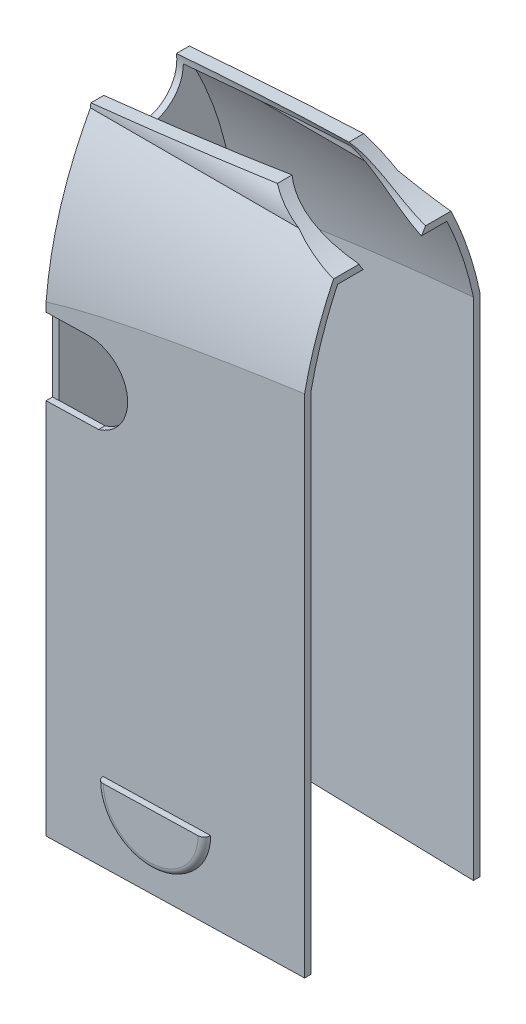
ISO-10303-21;
HEADER;
FILE_DESCRIPTION(('STEP AP214'),'2;1');
FILE_NAME('part.step','',(''),(''),'','','');
FILE_SCHEMA(('AUTOMOTIVE_DESIGN { 1 0 10303 214 1 1 1 1 }'));
ENDSEC;
DATA;
#1=APPLICATION_CONTEXT('core data for automotive mechanical design processes');
#2=APPLICATION_PROTOCOL_DEFINITION('international standard','automotive_design',2000,#1);
#3=PRODUCT_CONTEXT('',#1,'mechanical');
#4=PRODUCT('Part','Part','',(#3));
#5=PRODUCT_RELATED_PRODUCT_CATEGORY('part','',(#4));
#6=PRODUCT_DEFINITION_FORMATION('','',#4);
#7=PRODUCT_DEFINITION_CONTEXT('part definition',#1,'design');
#8=PRODUCT_DEFINITION('design','',#6,#7);
#9=PRODUCT_DEFINITION_SHAPE('','',#8);
#10=(LENGTH_UNIT() NAMED_UNIT(*) SI_UNIT(.MILLI.,.METRE.));
#11=(NAMED_UNIT(*) PLANE_ANGLE_UNIT() SI_UNIT($,.RADIAN.));
#12=(NAMED_UNIT(*) SI_UNIT($,.STERADIAN.) SOLID_ANGLE_UNIT());
#13=UNCERTAINTY_MEASURE_WITH_UNIT(LENGTH_MEASURE(1.E-05),#10,'distance_accuracy_value','');
#14=(GEOMETRIC_REPRESENTATION_CONTEXT(3) GLOBAL_UNCERTAINTY_ASSIGNED_CONTEXT((#13)) GLOBAL_UNIT_ASSIGNED_CONTEXT((#10,
#11,#12)) REPRESENTATION_CONTEXT('',''));
#15=CARTESIAN_POINT('',(0.,0.,0.));
#16=DIRECTION('',(0.,0.,1.));
#17=DIRECTION('',(1.,0.,0.));
#18=AXIS2_PLACEMENT_3D('',#15,#16,#17);
#19=CARTESIAN_POINT('',(30.9859588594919,-1.2E-05,-10.5751226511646));
#20=DIRECTION('',(-0.0251300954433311,0.,0.9996841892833));
#21=DIRECTION('',(0.9996841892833,0.,0.0251300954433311));
#22=AXIS2_PLACEMENT_3D('',#19,#20,#21);
#23=PLANE('',#22);
#24=DIRECTION('',(0.,1.,0.));
#25=VECTOR('',#24,1.);
#26=CARTESIAN_POINT('',(29.7233177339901,-1.2E-05,-10.606862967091));
#27=LINE('',#26,#25);
#28=CARTESIAN_POINT('',(29.7233177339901,0.,-10.606862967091));
#29=VERTEX_POINT('',#28);
#30=CARTESIAN_POINT('',(29.7233177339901,61.2167960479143,-10.606862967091));
#31=VERTEX_POINT('',#30);
#32=EDGE_CURVE('E702',#29,#31,#27,.T.);
#33=ORIENTED_EDGE('',*,*,#32,.F.);
#34=DIRECTION('',(-0.9996841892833,0.,-0.0251300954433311));
#35=VECTOR('',#34,1.);
#36=CARTESIAN_POINT('',(0.0197874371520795,0.,-11.3535513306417));
#37=LINE('',#36,#35);
#38=CARTESIAN_POINT('',(-0.7874,0.,-11.3738424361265));
#39=VERTEX_POINT('',#38);
#40=EDGE_CURVE('E407',#29,#39,#37,.T.);
#41=ORIENTED_EDGE('',*,*,#40,.T.);
#42=DIRECTION('',(0.,-1.,0.));
#43=VECTOR('',#42,1.);
#44=CARTESIAN_POINT('',(-0.787399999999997,-1.2E-05,-11.3738424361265));
#45=LINE('',#44,#43);
#46=CARTESIAN_POINT('',(-0.78739999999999,55.9759619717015,-11.3738424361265));
#47=VERTEX_POINT('',#46);
#48=EDGE_CURVE('E455',#47,#39,#45,.T.);
#49=ORIENTED_EDGE('',*,*,#48,.F.);
#50=CARTESIAN_POINT('',(-0.78739999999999,55.9759619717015,-11.3738424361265));
#51=CARTESIAN_POINT('',(-0.566560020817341,56.0399732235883,-11.3682909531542));
#52=CARTESIAN_POINT('',(-0.345312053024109,56.1025614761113,-11.3627292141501));
#53=CARTESIAN_POINT('',(0.0978851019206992,56.2251777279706,-11.3515881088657));
#54=CARTESIAN_POINT('',(0.31983426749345,56.2852058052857,-11.3460087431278));
#55=CARTESIAN_POINT('',(0.764303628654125,56.4029836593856,-11.3348356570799));
#56=CARTESIAN_POINT('',(0.986823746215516,56.460733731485,-11.3292419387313));
#57=CARTESIAN_POINT('',(1.43238553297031,56.574188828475,-11.3180413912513));
#58=CARTESIAN_POINT('',(1.65542720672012,56.6298938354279,-11.3124345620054));
#59=CARTESIAN_POINT('',(2.3244257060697,56.7940429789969,-11.2956172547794));
#60=CARTESIAN_POINT('',(2.77105927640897,56.8997324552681,-11.2843897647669));
#61=CARTESIAN_POINT('',(3.6657408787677,57.1049866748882,-11.2618992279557));
#62=CARTESIAN_POINT('',(4.11378896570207,57.2045511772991,-11.2506361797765));
#63=CARTESIAN_POINT('',(5.01068614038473,57.3983947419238,-11.2280899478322));
#64=CARTESIAN_POINT('',(5.45953441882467,57.4926775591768,-11.2168067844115));
#65=CARTESIAN_POINT('',(6.3581431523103,57.6767438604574,-11.1942175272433));
#66=CARTESIAN_POINT('',(6.80790359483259,57.7665274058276,-11.1829114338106));
#67=CARTESIAN_POINT('',(7.70807745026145,57.9421382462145,-11.1602828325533));
#68=CARTESIAN_POINT('',(8.15849067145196,58.0279665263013,-11.1489603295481));
#69=CARTESIAN_POINT('',(9.0599659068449,58.1961431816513,-11.1262990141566));
#70=CARTESIAN_POINT('',(9.51102792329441,58.2784915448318,-11.1149602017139));
#71=CARTESIAN_POINT('',(10.8649845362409,58.5208843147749,-11.0809243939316));
#72=CARTESIAN_POINT('',(11.7687108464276,58.6762882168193,-11.0582064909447));
#73=CARTESIAN_POINT('',(13.5778445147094,58.9770328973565,-11.012728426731));
#74=CARTESIAN_POINT('',(14.4832519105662,59.1223734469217,-10.9899682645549));
#75=CARTESIAN_POINT('',(16.2947385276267,59.4045396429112,-10.9444310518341));
#76=CARTESIAN_POINT('',(17.2008168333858,59.5413711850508,-10.9216540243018));
#77=CARTESIAN_POINT('',(19.0142694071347,59.8079172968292,-10.8760673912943));
#78=CARTESIAN_POINT('',(19.9216439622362,59.9376299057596,-10.8532577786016));
#79=CARTESIAN_POINT('',(21.7375610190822,60.1909099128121,-10.8076091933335));
#80=CARTESIAN_POINT('',(22.6461038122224,60.3144752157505,-10.7847702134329));
#81=CARTESIAN_POINT('',(24.4642554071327,60.5562290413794,-10.7390654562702));
#82=CARTESIAN_POINT('',(25.3738644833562,60.6744154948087,-10.7161996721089));
#83=CARTESIAN_POINT('',(27.1940650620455,60.9060379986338,-10.6704434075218));
#84=CARTESIAN_POINT('',(28.1046568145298,61.0194720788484,-10.6475529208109));
#85=CARTESIAN_POINT('',(29.9267583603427,61.2420823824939,-10.601748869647));
#86=CARTESIAN_POINT('',(30.8382683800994,61.3512567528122,-10.5788352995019));
#87=CARTESIAN_POINT('',(31.75,61.4585247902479,-10.5559161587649));
#88=B_SPLINE_CURVE_WITH_KNOTS('',3,(#50,#51,#52,#53,#54,#55,#56,#57,#58,#59,#60,#61,#62,#63,#64,
#65,#66,#67,#68,#69,#70,#71,#72,#73,#74,#75,#76,#77,#78,#79,#80,#81,#82,#83,#84,#85,#86,#87),
.UNSPECIFIED.,.F.,.F.,(4,2,2,2,2,2,2,2,2,2,2,2,2,2,2,2,2,2,4),(0.,0.689979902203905,
1.37993877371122,2.06980790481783,2.7596830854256,4.13694132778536,5.51425371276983,
6.89057412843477,8.26687577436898,9.64283277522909,11.0187945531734,13.7705312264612,
16.5223304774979,19.272201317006,22.0228257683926,24.774381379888,27.526986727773,
30.2807221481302,33.0356424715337),.UNSPECIFIED.);
#89=EDGE_CURVE('E472',#47,#31,#88,.T.);
#90=ORIENTED_EDGE('',*,*,#89,.T.);
#91=EDGE_LOOP('',(#33,#41,#49,#90));
#92=FACE_BOUND('',#91,.T.);
#93=CARTESIAN_POINT('',(12.2894688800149,9.525,-11.0451156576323));
#94=DIRECTION('',(0.0251300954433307,0.,-0.9996841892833));
#95=DIRECTION('',(-0.9996841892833,0.,-0.0251300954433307));
#96=AXIS2_PLACEMENT_3D('',#93,#94,#95);
#97=CIRCLE('',#96,6.35);
#98=CARTESIAN_POINT('',(18.6374634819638,9.525,-10.8855395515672));
#99=VERTEX_POINT('',#98);
#100=CARTESIAN_POINT('',(5.9414742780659,9.525,-11.2046917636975));
#101=VERTEX_POINT('',#100);
#102=EDGE_CURVE('E283',#99,#101,#97,.T.);
#103=ORIENTED_EDGE('',*,*,#102,.F.);
#104=DIRECTION('',(0.9996841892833,0.,0.0251300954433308));
#105=VECTOR('',#104,1.);
#106=CARTESIAN_POINT('',(18.6374634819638,9.525,-10.8855395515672));
#107=LINE('',#106,#105);
#108=EDGE_CURVE('E284',#101,#99,#107,.T.);
#109=ORIENTED_EDGE('',*,*,#108,.F.);
#110=EDGE_LOOP('',(#103,#109));
#111=FACE_BOUND('',#110,.T.);
#112=ADVANCED_FACE('F45',(#92,#111),#23,.F.);
#113=CARTESIAN_POINT('',(30.9859588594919,-1.2E-05,10.5751226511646));
#114=DIRECTION('',(-0.0251300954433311,0.,-0.9996841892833));
#115=DIRECTION('',(0.9996841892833,0.,-0.0251300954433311));
#116=AXIS2_PLACEMENT_3D('',#113,#114,#115);
#117=PLANE('',#116);
#118=DIRECTION('',(0.9996841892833,0.,-0.0251300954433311));
#119=VECTOR('',#118,1.);
#120=CARTESIAN_POINT('',(0.657971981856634,45.6196716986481,11.3375086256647));
#121=LINE('',#120,#119);
#122=CARTESIAN_POINT('',(-0.787399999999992,45.6196716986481,11.3738424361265));
#123=VERTEX_POINT('',#122);
#124=CARTESIAN_POINT('',(5.40784432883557,45.6196716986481,11.2181061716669));
#125=VERTEX_POINT('',#124);
#126=EDGE_CURVE('E1150',#123,#125,#121,.T.);
#127=ORIENTED_EDGE('',*,*,#126,.F.);
#128=DIRECTION('',(0.,-1.,0.));
#129=VECTOR('',#128,1.);
#130=CARTESIAN_POINT('',(-0.787399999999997,-1.2E-05,11.3738424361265));
#131=LINE('',#130,#129);
#132=CARTESIAN_POINT('',(-0.7874,0.,11.3738424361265));
#133=VERTEX_POINT('',#132);
#134=EDGE_CURVE('E503',#123,#133,#131,.T.);
#135=ORIENTED_EDGE('',*,*,#134,.T.);
#136=DIRECTION('',(-0.9996841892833,0.,0.0251300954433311));
#137=VECTOR('',#136,1.);
#138=CARTESIAN_POINT('',(0.0197874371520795,0.,11.3535513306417));
#139=LINE('',#138,#137);
#140=CARTESIAN_POINT('',(29.7233177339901,0.,10.606862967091));
#141=VERTEX_POINT('',#140);
#142=EDGE_CURVE('E511',#141,#133,#139,.T.);
#143=ORIENTED_EDGE('',*,*,#142,.F.);
#144=DIRECTION('',(0.,-1.,0.));
#145=VECTOR('',#144,1.);
#146=CARTESIAN_POINT('',(29.7233177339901,-1.2E-05,10.606862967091));
#147=LINE('',#146,#145);
#148=CARTESIAN_POINT('',(29.7233177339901,61.2167960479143,10.606862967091));
#149=VERTEX_POINT('',#148);
#150=EDGE_CURVE('E680',#149,#141,#147,.T.);
#151=ORIENTED_EDGE('',*,*,#150,.F.);
#152=CARTESIAN_POINT('',(-0.78739999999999,55.9759619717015,11.3738424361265));
#153=CARTESIAN_POINT('',(-0.566560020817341,56.0399732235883,11.3682909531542));
#154=CARTESIAN_POINT('',(-0.345312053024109,56.1025614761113,11.3627292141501));
#155=CARTESIAN_POINT('',(0.0978851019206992,56.2251777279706,11.3515881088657));
#156=CARTESIAN_POINT('',(0.31983426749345,56.2852058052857,11.3460087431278));
#157=CARTESIAN_POINT('',(0.764303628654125,56.4029836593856,11.3348356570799));
#158=CARTESIAN_POINT('',(0.986823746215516,56.460733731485,11.3292419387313));
#159=CARTESIAN_POINT('',(1.43238553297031,56.574188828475,11.3180413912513));
#160=CARTESIAN_POINT('',(1.65542720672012,56.6298938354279,11.3124345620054));
#161=CARTESIAN_POINT('',(2.3244257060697,56.7940429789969,11.2956172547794));
#162=CARTESIAN_POINT('',(2.77105927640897,56.8997324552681,11.2843897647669));
#163=CARTESIAN_POINT('',(3.6657408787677,57.1049866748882,11.2618992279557));
#164=CARTESIAN_POINT('',(4.11378896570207,57.2045511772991,11.2506361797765));
#165=CARTESIAN_POINT('',(5.01068614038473,57.3983947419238,11.2280899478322));
#166=CARTESIAN_POINT('',(5.45953441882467,57.4926775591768,11.2168067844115));
#167=CARTESIAN_POINT('',(6.3581431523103,57.6767438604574,11.1942175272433));
#168=CARTESIAN_POINT('',(6.80790359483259,57.7665274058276,11.1829114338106));
#169=CARTESIAN_POINT('',(7.70807745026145,57.9421382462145,11.1602828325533));
#170=CARTESIAN_POINT('',(8.15849067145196,58.0279665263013,11.1489603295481));
#171=CARTESIAN_POINT('',(9.0599659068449,58.1961431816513,11.1262990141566));
#172=CARTESIAN_POINT('',(9.51102792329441,58.2784915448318,11.1149602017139));
#173=CARTESIAN_POINT('',(10.8649845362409,58.5208843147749,11.0809243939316));
#174=CARTESIAN_POINT('',(11.7687108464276,58.6762882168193,11.0582064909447));
#175=CARTESIAN_POINT('',(13.5778445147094,58.9770328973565,11.012728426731));
#176=CARTESIAN_POINT('',(14.4832519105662,59.1223734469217,10.9899682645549));
#177=CARTESIAN_POINT('',(16.2947385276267,59.4045396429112,10.9444310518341));
#178=CARTESIAN_POINT('',(17.2008168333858,59.5413711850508,10.9216540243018));
#179=CARTESIAN_POINT('',(19.0142694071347,59.8079172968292,10.8760673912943));
#180=CARTESIAN_POINT('',(19.9216439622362,59.9376299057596,10.8532577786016));
#181=CARTESIAN_POINT('',(21.7375610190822,60.1909099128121,10.8076091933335));
#182=CARTESIAN_POINT('',(22.6461038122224,60.3144752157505,10.7847702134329));
#183=CARTESIAN_POINT('',(24.4642554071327,60.5562290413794,10.7390654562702));
#184=CARTESIAN_POINT('',(25.3738644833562,60.6744154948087,10.7161996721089));
#185=CARTESIAN_POINT('',(27.1940650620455,60.9060379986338,10.6704434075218));
#186=CARTESIAN_POINT('',(28.1046568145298,61.0194720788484,10.6475529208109));
#187=CARTESIAN_POINT('',(29.9267583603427,61.2420823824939,10.601748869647));
#188=CARTESIAN_POINT('',(30.8382683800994,61.3512567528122,10.5788352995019));
#189=CARTESIAN_POINT('',(31.75,61.4585247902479,10.5559161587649));
#190=B_SPLINE_CURVE_WITH_KNOTS('',3,(#152,#153,#154,#155,#156,#157,#158,#159,#160,#161,#162,
#163,#164,#165,#166,#167,#168,#169,#170,#171,#172,#173,#174,#175,#176,#177,#178,#179,#180,#181,
#182,#183,#184,#185,#186,#187,#188,#189),.UNSPECIFIED.,.F.,.F.,(4,2,2,2,2,2,2,2,2,2,2,2,2,2,2,2,
2,2,4),(0.,0.689979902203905,1.37993877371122,2.06980790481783,2.7596830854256,4.13694132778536,
5.51425371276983,6.89057412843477,8.26687577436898,9.64283277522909,11.0187945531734,
13.7705312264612,16.5223304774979,19.272201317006,22.0228257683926,24.774381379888,
27.526986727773,30.2807221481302,33.0356424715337),.UNSPECIFIED.);
#191=CARTESIAN_POINT('',(-0.78739999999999,55.9759619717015,11.3738424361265));
#192=VERTEX_POINT('',#191);
#193=EDGE_CURVE('E563',#192,#149,#190,.T.);
#194=ORIENTED_EDGE('',*,*,#193,.F.);
#195=CARTESIAN_POINT('',(-0.78739999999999,54.8906716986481,11.3738424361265));
#196=VERTEX_POINT('',#195);
#197=EDGE_CURVE('E518',#192,#196,#131,.T.);
#198=ORIENTED_EDGE('',*,*,#197,.T.);
#199=DIRECTION('',(-0.9996841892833,0.,0.0251300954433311));
#200=VECTOR('',#199,1.);
#201=CARTESIAN_POINT('',(4.7701733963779,54.8906716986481,11.2341359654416));
#202=LINE('',#201,#200);
#203=CARTESIAN_POINT('',(4.11480000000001,54.8906716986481,11.2506107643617));
#204=VERTEX_POINT('',#203);
#205=EDGE_CURVE('E670',#204,#196,#202,.T.);
#206=ORIENTED_EDGE('',*,*,#205,.F.);
#207=CARTESIAN_POINT('',(4.11480000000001,50.165,11.2506107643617));
#208=DIRECTION('',(-0.0251300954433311,0.,-0.9996841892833));
#209=DIRECTION('',(-0.9996841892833,0.,0.0251300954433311));
#210=AXIS2_PLACEMENT_3D('',#207,#208,#209);
#211=ELLIPSE('',#210,4.7271645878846,4.72567169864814);
#212=EDGE_CURVE('E1152',#125,#204,#211,.F.);
#213=ORIENTED_EDGE('',*,*,#212,.F.);
#214=EDGE_LOOP('',(#127,#135,#143,#151,#194,#198,#206,#213));
#215=FACE_BOUND('',#214,.T.);
#216=CARTESIAN_POINT('',(12.2894688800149,9.525,11.0451156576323));
#217=DIRECTION('',(0.0251300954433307,0.,0.9996841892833));
#218=DIRECTION('',(0.9996841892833,0.,-0.0251300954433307));
#219=AXIS2_PLACEMENT_3D('',#216,#217,#218);
#220=CIRCLE('',#219,6.35);
#221=CARTESIAN_POINT('',(5.9414742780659,9.525,11.2046917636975));
#222=VERTEX_POINT('',#221);
#223=CARTESIAN_POINT('',(18.6374634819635,9.525,10.8855395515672));
#224=VERTEX_POINT('',#223);
#225=EDGE_CURVE('E1117',#222,#224,#220,.T.);
#226=ORIENTED_EDGE('',*,*,#225,.F.);
#227=DIRECTION('',(-0.9996841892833,0.,0.0251300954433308));
#228=VECTOR('',#227,1.);
#229=CARTESIAN_POINT('',(5.9414742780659,9.525,11.2046917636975));
#230=LINE('',#229,#228);
#231=EDGE_CURVE('E1120',#224,#222,#230,.T.);
#232=ORIENTED_EDGE('',*,*,#231,.F.);
#233=EDGE_LOOP('',(#226,#232));
#234=FACE_BOUND('',#233,.T.);
#235=ADVANCED_FACE('F487',(#215,#234),#117,.F.);
#236=CARTESIAN_POINT('',(0.,0.,-10.5664));
#237=DIRECTION('',(-1.,0.,0.));
#238=DIRECTION('',(0.,0.,1.));
#239=AXIS2_PLACEMENT_3D('',#236,#237,#238);
#240=PLANE('',#239);
#241=CARTESIAN_POINT('',(0.,16.891,-7.493));
#242=DIRECTION('',(-1.,0.,0.));
#243=DIRECTION('',(0.,0.,1.));
#244=AXIS2_PLACEMENT_3D('',#241,#242,#243);
#245=CIRCLE('',#244,1.9812);
#246=CARTESIAN_POINT('',(0.,16.891,-5.5118));
#247=VERTEX_POINT('',#246);
#248=EDGE_CURVE('E743',#247,#247,#245,.F.);
#249=ORIENTED_EDGE('',*,*,#248,.F.);
#250=EDGE_LOOP('',(#249));
#251=FACE_BOUND('',#250,.T.);
#252=DIRECTION('',(0.,0.,1.));
#253=VECTOR('',#252,1.);
#254=CARTESIAN_POINT('',(0.,33.655,3.175));
#255=LINE('',#254,#253);
#256=CARTESIAN_POINT('',(0.,33.655,-3.175));
#257=VERTEX_POINT('',#256);
#258=CARTESIAN_POINT('',(0.,33.655,3.175));
#259=VERTEX_POINT('',#258);
#260=EDGE_CURVE('E712',#257,#259,#255,.T.);
#261=ORIENTED_EDGE('',*,*,#260,.F.);
#262=DIRECTION('',(0.,1.,0.));
#263=VECTOR('',#262,1.);
#264=CARTESIAN_POINT('',(0.,33.655,-3.175));
#265=LINE('',#264,#263);
#266=CARTESIAN_POINT('',(0.,18.415,-3.17500000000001));
#267=VERTEX_POINT('',#266);
#268=EDGE_CURVE('E716',#267,#257,#265,.T.);
#269=ORIENTED_EDGE('',*,*,#268,.F.);
#270=DIRECTION('',(0.,0.,-1.));
#271=VECTOR('',#270,1.);
#272=CARTESIAN_POINT('',(0.,18.415,-3.17500000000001));
#273=LINE('',#272,#271);
#274=CARTESIAN_POINT('',(0.,18.415,3.175));
#275=VERTEX_POINT('',#274);
#276=EDGE_CURVE('E733',#275,#267,#273,.T.);
#277=ORIENTED_EDGE('',*,*,#276,.F.);
#278=DIRECTION('',(0.,-1.,0.));
#279=VECTOR('',#278,1.);
#280=CARTESIAN_POINT('',(0.,33.655,3.175));
#281=LINE('',#280,#279);
#282=EDGE_CURVE('E710',#259,#275,#281,.T.);
#283=ORIENTED_EDGE('',*,*,#282,.F.);
#284=EDGE_LOOP('',(#261,#269,#277,#283));
#285=FACE_BOUND('',#284,.T.);
#286=DIRECTION('',(0.,1.,0.));
#287=VECTOR('',#286,1.);
#288=CARTESIAN_POINT('',(0.,45.6196716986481,10.5864424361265));
#289=LINE('',#288,#287);
#290=CARTESIAN_POINT('',(0.,45.6196716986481,10.5864424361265));
#291=VERTEX_POINT('',#290);
#292=CARTESIAN_POINT('',(0.,54.8906716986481,10.5864424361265));
#293=VERTEX_POINT('',#292);
#294=EDGE_CURVE('E1125',#291,#293,#289,.T.);
#295=ORIENTED_EDGE('',*,*,#294,.F.);
#296=DIRECTION('',(0.,0.,1.));
#297=VECTOR('',#296,1.);
#298=CARTESIAN_POINT('',(0.,45.6196716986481,-14.836852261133));
#299=LINE('',#298,#297);
#300=CARTESIAN_POINT('',(0.,45.6196716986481,10.5664));
#301=VERTEX_POINT('',#300);
#302=EDGE_CURVE('E1160',#301,#291,#299,.T.);
#303=ORIENTED_EDGE('',*,*,#302,.F.);
#304=DIRECTION('',(0.,-1.,0.));
#305=VECTOR('',#304,1.);
#306=CARTESIAN_POINT('',(0.,0.,10.5664));
#307=LINE('',#306,#305);
#308=CARTESIAN_POINT('',(0.,0.,10.5664));
#309=VERTEX_POINT('',#308);
#310=EDGE_CURVE('E300',#301,#309,#307,.T.);
#311=ORIENTED_EDGE('',*,*,#310,.T.);
#312=DIRECTION('',(0.,0.,1.));
#313=VECTOR('',#312,1.);
#314=CARTESIAN_POINT('',(0.,0.,-10.5664));
#315=LINE('',#314,#313);
#316=CARTESIAN_POINT('',(0.,0.,-10.5664));
#317=VERTEX_POINT('',#316);
#318=EDGE_CURVE('E640',#317,#309,#315,.T.);
#319=ORIENTED_EDGE('',*,*,#318,.F.);
#320=DIRECTION('',(0.,-1.,0.));
#321=VECTOR('',#320,1.);
#322=CARTESIAN_POINT('',(0.,0.,-10.5664));
#323=LINE('',#322,#321);
#324=CARTESIAN_POINT('',(0.,56.1644909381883,-10.5664));
#325=VERTEX_POINT('',#324);
#326=EDGE_CURVE('E635',#325,#317,#323,.T.);
#327=ORIENTED_EDGE('',*,*,#326,.F.);
#328=CARTESIAN_POINT('',(0.,55.88,-10.5918));
#329=CARTESIAN_POINT('',(0.,65.1395149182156,-9.79471571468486));
#330=CARTESIAN_POINT('',(0.,73.406,-5.2324));
#331=B_SPLINE_CURVE_WITH_KNOTS('',2,(#328,#329,#330),.UNSPECIFIED.,.F.,.F.,(3,3),(0.,1.),.UNSPECIFIED.);
#332=CARTESIAN_POINT('',(0.,73.406,-5.2324));
#333=VERTEX_POINT('',#332);
#334=EDGE_CURVE('E796',#325,#333,#331,.T.);
#335=ORIENTED_EDGE('',*,*,#334,.T.);
#336=DIRECTION('',(0.,0.,1.));
#337=VECTOR('',#336,1.);
#338=CARTESIAN_POINT('',(0.,73.406,-10.5664));
#339=LINE('',#338,#337);
#340=CARTESIAN_POINT('',(0.,73.406,-4.445));
#341=VERTEX_POINT('',#340);
#342=EDGE_CURVE('E638',#333,#341,#339,.T.);
#343=ORIENTED_EDGE('',*,*,#342,.T.);
#344=CARTESIAN_POINT('',(0.,73.406,0.));
#345=DIRECTION('',(-1.,0.,0.));
#346=DIRECTION('',(0.,0.,1.));
#347=AXIS2_PLACEMENT_3D('',#344,#345,#346);
#348=CIRCLE('',#347,4.445);
#349=CARTESIAN_POINT('',(0.,73.406,4.445));
#350=VERTEX_POINT('',#349);
#351=EDGE_CURVE('E622',#341,#350,#348,.T.);
#352=ORIENTED_EDGE('',*,*,#351,.T.);
#353=DIRECTION('',(0.,0.,-1.));
#354=VECTOR('',#353,1.);
#355=CARTESIAN_POINT('',(0.,73.406,10.5664));
#356=LINE('',#355,#354);
#357=CARTESIAN_POINT('',(0.,73.406,5.2324));
#358=VERTEX_POINT('',#357);
#359=EDGE_CURVE('E326',#358,#350,#356,.T.);
#360=ORIENTED_EDGE('',*,*,#359,.F.);
#361=CARTESIAN_POINT('',(0.,55.88,10.5918));
#362=CARTESIAN_POINT('',(0.,65.1395149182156,9.79471571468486));
#363=CARTESIAN_POINT('',(0.,73.406,5.2324));
#364=B_SPLINE_CURVE_WITH_KNOTS('',2,(#361,#362,#363),.UNSPECIFIED.,.F.,.F.,(3,3),(0.,1.),.UNSPECIFIED.);
#365=CARTESIAN_POINT('',(0.,56.1644909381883,10.5664));
#366=VERTEX_POINT('',#365);
#367=EDGE_CURVE('E742',#366,#358,#364,.T.);
#368=ORIENTED_EDGE('',*,*,#367,.F.);
#369=CARTESIAN_POINT('',(0.,54.8906716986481,10.5664));
#370=VERTEX_POINT('',#369);
#371=EDGE_CURVE('E303',#366,#370,#307,.T.);
#372=ORIENTED_EDGE('',*,*,#371,.T.);
#373=DIRECTION('',(0.,0.,1.));
#374=VECTOR('',#373,1.);
#375=CARTESIAN_POINT('',(0.,54.8906716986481,-14.836852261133));
#376=LINE('',#375,#374);
#377=EDGE_CURVE('E1163',#370,#293,#376,.T.);
#378=ORIENTED_EDGE('',*,*,#377,.T.);
#379=EDGE_LOOP('',(#295,#303,#311,#319,#327,#335,#343,#352,#360,#368,#372,#378));
#380=FACE_BOUND('',#379,.T.);
#381=ADVANCED_FACE('F426',(#251,#285,#380),#240,.F.);
#382=CARTESIAN_POINT('',(30.962625,73.406,0.));
#383=DIRECTION('',(-1.,0.,0.));
#384=DIRECTION('',(0.,0.,1.));
#385=AXIS2_PLACEMENT_3D('',#382,#383,#384);
#386=CYLINDRICAL_SURFACE('',#385,4.445);
#387=CARTESIAN_POINT('',(29.7233177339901,73.406,0.));
#388=DIRECTION('',(1.,0.,0.));
#389=DIRECTION('',(0.,0.,-1.));
#390=AXIS2_PLACEMENT_3D('',#387,#388,#389);
#391=CIRCLE('',#390,4.445);
#392=CARTESIAN_POINT('',(29.7233177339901,71.5005117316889,-4.01586098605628));
#393=VERTEX_POINT('',#392);
#394=CARTESIAN_POINT('',(29.7233177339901,70.6937806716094,-3.52163191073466));
#395=VERTEX_POINT('',#394);
#396=EDGE_CURVE('E709',#393,#395,#391,.F.);
#397=ORIENTED_EDGE('',*,*,#396,.F.);
#398=CARTESIAN_POINT('',(29.8910766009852,71.4631022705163,-3.99789612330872));
#399=CARTESIAN_POINT('',(29.6529462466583,71.5150307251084,-4.02311807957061));
#400=CARTESIAN_POINT('',(29.4159706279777,71.5716979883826,-4.04942104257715));
#401=CARTESIAN_POINT('',(28.9445441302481,71.6944459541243,-4.10281820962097));
#402=CARTESIAN_POINT('',(28.7100934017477,71.7605272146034,-4.12991246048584));
#403=CARTESIAN_POINT('',(28.2430162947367,71.9023193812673,-4.1836266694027));
#404=CARTESIAN_POINT('',(28.0104011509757,71.978068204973,-4.21024426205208));
#405=CARTESIAN_POINT('',(27.5482017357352,72.1389251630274,-4.26141668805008));
#406=CARTESIAN_POINT('',(27.3186173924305,72.224033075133,-4.28597157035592));
#407=CARTESIAN_POINT('',(26.8554784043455,72.4064073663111,-4.33220147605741));
#408=CARTESIAN_POINT('',(26.6220302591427,72.5039746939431,-4.35375984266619));
#409=CARTESIAN_POINT('',(26.1590172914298,72.7089068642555,-4.39123416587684));
#410=CARTESIAN_POINT('',(25.9294522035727,72.8162710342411,-4.40715050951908));
#411=CARTESIAN_POINT('',(25.4750892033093,73.0404282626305,-4.43137315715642));
#412=CARTESIAN_POINT('',(25.2502830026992,73.1572028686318,-4.43969397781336));
#413=CARTESIAN_POINT('',(24.8056475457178,73.4000556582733,-4.4466554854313));
#414=CARTESIAN_POINT('',(24.5858168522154,73.5261311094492,-4.44529900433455));
#415=CARTESIAN_POINT('',(24.1719263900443,73.7750817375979,-4.4312384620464));
#416=CARTESIAN_POINT('',(23.9773628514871,73.8971754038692,-4.41959496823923));
#417=CARTESIAN_POINT('',(23.5936677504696,74.1481351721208,-4.38444075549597));
#418=CARTESIAN_POINT('',(23.4045370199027,74.2770023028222,-4.36092822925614));
#419=CARTESIAN_POINT('',(23.0348733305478,74.5391207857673,-4.3002260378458));
#420=CARTESIAN_POINT('',(22.854265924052,74.6723036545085,-4.26319874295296));
#421=CARTESIAN_POINT('',(22.5006320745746,74.9431512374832,-4.17319507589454));
#422=CARTESIAN_POINT('',(22.3276025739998,75.0808141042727,-4.1202252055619));
#423=CARTESIAN_POINT('',(21.9586402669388,75.385265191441,-3.98413316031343));
#424=CARTESIAN_POINT('',(21.7645414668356,75.5526503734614,-3.89720865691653));
#425=CARTESIAN_POINT('',(21.4844416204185,75.8042269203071,-3.74383655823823));
#426=CARTESIAN_POINT('',(21.392452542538,75.8886236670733,-3.68852136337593));
#427=CARTESIAN_POINT('',(21.212947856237,76.056620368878,-3.5697088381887));
#428=CARTESIAN_POINT('',(21.1254368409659,76.1402194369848,-3.50620333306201));
#429=CARTESIAN_POINT('',(21.0404399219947,76.2230057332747,-3.43838678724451));
#430=B_SPLINE_CURVE_WITH_KNOTS('',3,(#398,#399,#400,#401,#402,#403,#404,#405,#406,#407,#408,
#409,#410,#411,#412,#413,#414,#415,#416,#417,#418,#419,#420,#421,#422,#423,#424,#425,#426,#427,
#428,#429),.UNSPECIFIED.,.F.,.F.,(4,2,2,2,2,2,2,2,2,2,2,2,2,2,2,4),(0.,0.735025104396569,
1.47009379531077,2.20813962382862,2.94616793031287,3.70770646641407,4.46919275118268,
5.22922060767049,5.98902606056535,6.67859472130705,7.36826841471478,8.04991514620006,
8.73128425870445,9.54114217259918,9.95049368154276,10.3602569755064),.UNSPECIFIED.);
#431=CARTESIAN_POINT('',(21.0404399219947,76.2230057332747,-3.43838678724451));
#432=VERTEX_POINT('',#431);
#433=EDGE_CURVE('E402',#393,#432,#430,.T.);
#434=ORIENTED_EDGE('',*,*,#433,.T.);
#435=CARTESIAN_POINT('',(-8.21528319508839,73.406,0.));
#436=DIRECTION('',(-0.0958457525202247,0.995396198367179,0.));
#437=DIRECTION('',(-0.995396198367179,-0.0958457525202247,0.));
#438=AXIS2_PLACEMENT_3D('',#435,#436,#437);
#439=ELLIPSE('',#438,46.3765986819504,4.445);
#440=CARTESIAN_POINT('',(-0.7874,74.1212238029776,-4.38708102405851));
#441=VERTEX_POINT('',#440);
#442=EDGE_CURVE('E404',#432,#441,#439,.T.);
#443=ORIENTED_EDGE('',*,*,#442,.T.);
#444=CARTESIAN_POINT('',(-0.787399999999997,73.406,0.));
#445=DIRECTION('',(-1.,0.,0.));
#446=DIRECTION('',(0.,0.,1.));
#447=AXIS2_PLACEMENT_3D('',#444,#445,#446);
#448=CIRCLE('',#447,4.445);
#449=CARTESIAN_POINT('',(-0.7874,74.1212238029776,4.38708102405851));
#450=VERTEX_POINT('',#449);
#451=EDGE_CURVE('E397',#441,#450,#448,.T.);
#452=ORIENTED_EDGE('',*,*,#451,.T.);
#453=CARTESIAN_POINT('',(-8.21528319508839,73.406,0.));
#454=DIRECTION('',(0.0958457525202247,-0.995396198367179,0.));
#455=DIRECTION('',(-0.995396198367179,-0.0958457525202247,0.));
#456=AXIS2_PLACEMENT_3D('',#453,#454,#455);
#457=ELLIPSE('',#456,46.3765986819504,4.445);
#458=CARTESIAN_POINT('',(21.0404399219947,76.2230057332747,3.43838678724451));
#459=VERTEX_POINT('',#458);
#460=EDGE_CURVE('E516',#459,#450,#457,.T.);
#461=ORIENTED_EDGE('',*,*,#460,.F.);
#462=CARTESIAN_POINT('',(29.8910766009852,71.4631022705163,3.99789612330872));
#463=CARTESIAN_POINT('',(29.6529462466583,71.5150307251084,4.02311807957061));
#464=CARTESIAN_POINT('',(29.4159706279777,71.5716979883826,4.04942104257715));
#465=CARTESIAN_POINT('',(28.9445441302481,71.6944459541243,4.10281820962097));
#466=CARTESIAN_POINT('',(28.7100934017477,71.7605272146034,4.12991246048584));
#467=CARTESIAN_POINT('',(28.2430162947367,71.9023193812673,4.1836266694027));
#468=CARTESIAN_POINT('',(28.0104011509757,71.978068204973,4.21024426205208));
#469=CARTESIAN_POINT('',(27.5482017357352,72.1389251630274,4.26141668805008));
#470=CARTESIAN_POINT('',(27.3186173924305,72.224033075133,4.28597157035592));
#471=CARTESIAN_POINT('',(26.8554784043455,72.4064073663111,4.33220147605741));
#472=CARTESIAN_POINT('',(26.6220302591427,72.5039746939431,4.35375984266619));
#473=CARTESIAN_POINT('',(26.1590172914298,72.7089068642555,4.39123416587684));
#474=CARTESIAN_POINT('',(25.9294522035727,72.8162710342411,4.40715050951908));
#475=CARTESIAN_POINT('',(25.4750892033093,73.0404282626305,4.43137315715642));
#476=CARTESIAN_POINT('',(25.2502830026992,73.1572028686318,4.43969397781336));
#477=CARTESIAN_POINT('',(24.8056475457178,73.4000556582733,4.4466554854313));
#478=CARTESIAN_POINT('',(24.5858168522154,73.5261311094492,4.44529900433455));
#479=CARTESIAN_POINT('',(24.1719263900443,73.7750817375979,4.4312384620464));
#480=CARTESIAN_POINT('',(23.9773628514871,73.8971754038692,4.41959496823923));
#481=CARTESIAN_POINT('',(23.5936677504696,74.1481351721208,4.38444075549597));
#482=CARTESIAN_POINT('',(23.4045370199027,74.2770023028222,4.36092822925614));
#483=CARTESIAN_POINT('',(23.0348733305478,74.5391207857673,4.3002260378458));
#484=CARTESIAN_POINT('',(22.854265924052,74.6723036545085,4.26319874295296));
#485=CARTESIAN_POINT('',(22.5006320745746,74.9431512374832,4.17319507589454));
#486=CARTESIAN_POINT('',(22.3276025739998,75.0808141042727,4.1202252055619));
#487=CARTESIAN_POINT('',(21.9586402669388,75.385265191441,3.98413316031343));
#488=CARTESIAN_POINT('',(21.7645414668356,75.5526503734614,3.89720865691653));
#489=CARTESIAN_POINT('',(21.4844416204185,75.8042269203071,3.74383655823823));
#490=CARTESIAN_POINT('',(21.392452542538,75.8886236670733,3.68852136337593));
#491=CARTESIAN_POINT('',(21.212947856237,76.056620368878,3.5697088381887));
#492=CARTESIAN_POINT('',(21.1254368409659,76.1402194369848,3.50620333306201));
#493=CARTESIAN_POINT('',(21.0404399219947,76.2230057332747,3.43838678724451));
#494=B_SPLINE_CURVE_WITH_KNOTS('',3,(#462,#463,#464,#465,#466,#467,#468,#469,#470,#471,#472,
#473,#474,#475,#476,#477,#478,#479,#480,#481,#482,#483,#484,#485,#486,#487,#488,#489,#490,#491,
#492,#493),.UNSPECIFIED.,.F.,.F.,(4,2,2,2,2,2,2,2,2,2,2,2,2,2,2,4),(0.,0.735025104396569,
1.47009379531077,2.20813962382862,2.94616793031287,3.70770646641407,4.46919275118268,
5.22922060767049,5.98902606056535,6.67859472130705,7.36826841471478,8.04991514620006,
8.73128425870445,9.54114217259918,9.95049368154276,10.3602569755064),.UNSPECIFIED.);
#495=CARTESIAN_POINT('',(29.7233177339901,71.5005117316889,4.01586098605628));
#496=VERTEX_POINT('',#495);
#497=EDGE_CURVE('E521',#496,#459,#494,.T.);
#498=ORIENTED_EDGE('',*,*,#497,.F.);
#499=CARTESIAN_POINT('',(29.7233177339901,70.6937806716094,3.52163191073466));
#500=VERTEX_POINT('',#499);
#501=EDGE_CURVE('E760',#500,#496,#391,.F.);
#502=ORIENTED_EDGE('',*,*,#501,.F.);
#503=CARTESIAN_POINT('',(29.7233177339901,70.6937806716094,3.52163191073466));
#504=CARTESIAN_POINT('',(29.4691495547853,70.7492108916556,3.56432536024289));
#505=CARTESIAN_POINT('',(29.21645370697,70.8097610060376,3.60887108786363));
#506=CARTESIAN_POINT('',(28.714047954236,70.9410570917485,3.69979074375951));
#507=CARTESIAN_POINT('',(28.4643381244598,71.0118033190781,3.74616471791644));
#508=CARTESIAN_POINT('',(27.7177762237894,71.2398743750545,3.88558298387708));
#509=CARTESIAN_POINT('',(27.2255330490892,71.4125861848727,3.97855073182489));
#510=CARTESIAN_POINT('',(26.2390788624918,71.8050515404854,4.1524215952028));
#511=CARTESIAN_POINT('',(25.7452990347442,72.0261214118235,4.23284950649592));
#512=CARTESIAN_POINT('',(25.0181313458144,72.3898278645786,4.32909618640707));
#513=CARTESIAN_POINT('',(24.7781981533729,72.5162879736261,4.35709857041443));
#514=CARTESIAN_POINT('',(24.303230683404,72.7797810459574,4.40269898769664));
#515=CARTESIAN_POINT('',(24.0681950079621,72.9168109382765,4.4203000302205));
#516=CARTESIAN_POINT('',(23.6128167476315,73.1955753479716,4.44213031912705));
#517=CARTESIAN_POINT('',(23.392258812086,73.3369171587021,4.44685492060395));
#518=CARTESIAN_POINT('',(22.9571617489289,73.6285824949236,4.44181977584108));
#519=CARTESIAN_POINT('',(22.7426245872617,73.7789089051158,4.43205535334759));
#520=CARTESIAN_POINT('',(22.3230742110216,74.0859407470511,4.39537973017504));
#521=CARTESIAN_POINT('',(22.1179846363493,74.2425626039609,4.36864968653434));
#522=CARTESIAN_POINT('',(21.7166116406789,74.5620942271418,4.29514964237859));
#523=CARTESIAN_POINT('',(21.5203201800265,74.7249979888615,4.24839836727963));
#524=CARTESIAN_POINT('',(21.2311470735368,74.9747747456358,4.15993629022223));
#525=CARTESIAN_POINT('',(21.1343235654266,75.0601666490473,4.12679609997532));
#526=CARTESIAN_POINT('',(20.9434879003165,75.2318954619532,4.05374592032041));
#527=CARTESIAN_POINT('',(20.849486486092,75.3182346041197,4.01381317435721));
#528=CARTESIAN_POINT('',(20.7572148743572,75.4046924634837,3.97029639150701));
#529=B_SPLINE_CURVE_WITH_KNOTS('',3,(#503,#504,#505,#506,#507,#508,#509,#510,#511,#512,#513,
#514,#515,#516,#517,#518,#519,#520,#521,#522,#523,#524,#525,#526,#527,#528),.UNSPECIFIED.,.F.,
.F.,(4,2,2,2,2,2,2,2,2,2,2,2,4),(0.,0.79073262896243,1.58148511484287,3.16933803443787,
4.80746689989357,5.62509025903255,6.44247695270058,7.22794290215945,8.01366241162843,
8.79113008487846,9.56787219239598,9.96754437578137,10.3685829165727),.UNSPECIFIED.);
#530=CARTESIAN_POINT('',(20.7572148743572,75.4046924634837,3.97029639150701));
#531=VERTEX_POINT('',#530);
#532=EDGE_CURVE('E357',#500,#531,#529,.T.);
#533=ORIENTED_EDGE('',*,*,#532,.T.);
#534=CARTESIAN_POINT('',(0.,73.406,0.));
#535=DIRECTION('',(0.0958457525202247,-0.995396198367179,0.));
#536=DIRECTION('',(-0.995396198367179,-0.0958457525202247,0.));
#537=AXIS2_PLACEMENT_3D('',#534,#535,#536);
#538=ELLIPSE('',#537,46.3765986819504,4.445);
#539=EDGE_CURVE('E380',#531,#350,#538,.T.);
#540=ORIENTED_EDGE('',*,*,#539,.T.);
#541=ORIENTED_EDGE('',*,*,#351,.F.);
#542=CARTESIAN_POINT('',(0.,73.406,0.));
#543=DIRECTION('',(-0.0958457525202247,0.995396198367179,0.));
#544=DIRECTION('',(-0.995396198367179,-0.0958457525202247,0.));
#545=AXIS2_PLACEMENT_3D('',#542,#543,#544);
#546=ELLIPSE('',#545,46.3765986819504,4.445);
#547=CARTESIAN_POINT('',(20.7572148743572,75.4046924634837,-3.97029639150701));
#548=VERTEX_POINT('',#547);
#549=EDGE_CURVE('E627',#548,#341,#546,.T.);
#550=ORIENTED_EDGE('',*,*,#549,.F.);
#551=CARTESIAN_POINT('',(29.7233177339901,70.6937806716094,-3.52163191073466));
#552=CARTESIAN_POINT('',(29.4691495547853,70.7492108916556,-3.56432536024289));
#553=CARTESIAN_POINT('',(29.21645370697,70.8097610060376,-3.60887108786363));
#554=CARTESIAN_POINT('',(28.714047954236,70.9410570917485,-3.69979074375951));
#555=CARTESIAN_POINT('',(28.4643381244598,71.0118033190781,-3.74616471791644));
#556=CARTESIAN_POINT('',(27.7177762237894,71.2398743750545,-3.88558298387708));
#557=CARTESIAN_POINT('',(27.2255330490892,71.4125861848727,-3.97855073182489));
#558=CARTESIAN_POINT('',(26.2390788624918,71.8050515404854,-4.1524215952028));
#559=CARTESIAN_POINT('',(25.7452990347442,72.0261214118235,-4.23284950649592));
#560=CARTESIAN_POINT('',(25.0181313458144,72.3898278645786,-4.32909618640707));
#561=CARTESIAN_POINT('',(24.7781981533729,72.5162879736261,-4.35709857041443));
#562=CARTESIAN_POINT('',(24.303230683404,72.7797810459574,-4.40269898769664));
#563=CARTESIAN_POINT('',(24.0681950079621,72.9168109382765,-4.4203000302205));
#564=CARTESIAN_POINT('',(23.6128167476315,73.1955753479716,-4.44213031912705));
#565=CARTESIAN_POINT('',(23.392258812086,73.3369171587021,-4.44685492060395));
#566=CARTESIAN_POINT('',(22.9571617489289,73.6285824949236,-4.44181977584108));
#567=CARTESIAN_POINT('',(22.7426245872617,73.7789089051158,-4.43205535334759));
#568=CARTESIAN_POINT('',(22.3230742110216,74.0859407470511,-4.39537973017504));
#569=CARTESIAN_POINT('',(22.1179846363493,74.2425626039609,-4.36864968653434));
#570=CARTESIAN_POINT('',(21.7166116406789,74.5620942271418,-4.29514964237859));
#571=CARTESIAN_POINT('',(21.5203201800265,74.7249979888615,-4.24839836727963));
#572=CARTESIAN_POINT('',(21.2311470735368,74.9747747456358,-4.15993629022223));
#573=CARTESIAN_POINT('',(21.1343235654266,75.0601666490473,-4.12679609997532));
#574=CARTESIAN_POINT('',(20.9434879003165,75.2318954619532,-4.05374592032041));
#575=CARTESIAN_POINT('',(20.849486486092,75.3182346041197,-4.01381317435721));
#576=CARTESIAN_POINT('',(20.7572148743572,75.4046924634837,-3.97029639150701));
#577=B_SPLINE_CURVE_WITH_KNOTS('',3,(#551,#552,#553,#554,#555,#556,#557,#558,#559,#560,#561,
#562,#563,#564,#565,#566,#567,#568,#569,#570,#571,#572,#573,#574,#575,#576),.UNSPECIFIED.,.F.,
.F.,(4,2,2,2,2,2,2,2,2,2,2,2,4),(0.,0.79073262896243,1.58148511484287,3.16933803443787,
4.80746689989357,5.62509025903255,6.44247695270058,7.22794290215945,8.01366241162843,
8.79113008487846,9.56787219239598,9.96754437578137,10.3685829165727),.UNSPECIFIED.);
#578=EDGE_CURVE('E604',#395,#548,#577,.T.);
#579=ORIENTED_EDGE('',*,*,#578,.F.);
#580=EDGE_LOOP('',(#397,#434,#443,#452,#461,#498,#502,#533,#540,#541,#550,#579));
#581=FACE_BOUND('',#580,.T.);
#582=ADVANCED_FACE('F420',(#581),#386,.F.);
#583=CARTESIAN_POINT('',(0.,0.,-10.5664));
#584=DIRECTION('',(0.,-1.,0.));
#585=DIRECTION('',(0.,0.,-1.));
#586=AXIS2_PLACEMENT_3D('',#583,#584,#585);
#587=PLANE('',#586);
#588=ORIENTED_EDGE('',*,*,#40,.F.);
#589=DIRECTION('',(0.,0.,1.));
#590=VECTOR('',#589,1.);
#591=CARTESIAN_POINT('',(29.7233177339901,0.,3.52163191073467));
#592=LINE('',#591,#590);
#593=CARTESIAN_POINT('',(29.7233177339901,0.,-9.81921421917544));
#594=VERTEX_POINT('',#593);
#595=EDGE_CURVE('E662',#29,#594,#592,.T.);
#596=ORIENTED_EDGE('',*,*,#595,.T.);
#597=DIRECTION('',(-0.9996841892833,0.,-0.0251300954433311));
#598=VECTOR('',#597,1.);
#599=CARTESIAN_POINT('',(0.,0.,-10.5664));
#600=LINE('',#599,#598);
#601=EDGE_CURVE('E305',#594,#317,#600,.T.);
#602=ORIENTED_EDGE('',*,*,#601,.T.);
#603=ORIENTED_EDGE('',*,*,#318,.T.);
#604=DIRECTION('',(-0.9996841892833,0.,0.0251300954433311));
#605=VECTOR('',#604,1.);
#606=CARTESIAN_POINT('',(0.,0.,10.5664));
#607=LINE('',#606,#605);
#608=CARTESIAN_POINT('',(29.7233177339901,0.,9.81921421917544));
#609=VERTEX_POINT('',#608);
#610=EDGE_CURVE('E304',#609,#309,#607,.T.);
#611=ORIENTED_EDGE('',*,*,#610,.F.);
#612=EDGE_CURVE('E513',#609,#141,#592,.T.);
#613=ORIENTED_EDGE('',*,*,#612,.T.);
#614=ORIENTED_EDGE('',*,*,#142,.T.);
#615=DIRECTION('',(0.,0.,1.));
#616=VECTOR('',#615,1.);
#617=CARTESIAN_POINT('',(-0.7874,0.,-10.5664));
#618=LINE('',#617,#616);
#619=EDGE_CURVE('E461',#39,#133,#618,.T.);
#620=ORIENTED_EDGE('',*,*,#619,.F.);
#621=EDGE_LOOP('',(#588,#596,#602,#603,#611,#613,#614,#620));
#622=FACE_BOUND('',#621,.T.);
#623=ADVANCED_FACE('F425',(#622),#587,.T.);
#624=CARTESIAN_POINT('',(33.782,89.3064,-10.5664));
#625=DIRECTION('',(0.,0.,1.));
#626=DIRECTION('',(1.,0.,0.));
#627=AXIS2_PLACEMENT_3D('',#624,#625,#626);
#628=CYLINDRICAL_SURFACE('',#627,18.2626);
#629=ORIENTED_EDGE('',*,*,#433,.F.);
#630=DIRECTION('',(0.,0.,1.));
#631=VECTOR('',#630,1.);
#632=CARTESIAN_POINT('',(29.7233177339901,71.5005117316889,-10.5664));
#633=LINE('',#632,#631);
#634=CARTESIAN_POINT('',(29.7233177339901,71.5005117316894,-7.10361754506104));
#635=VERTEX_POINT('',#634);
#636=EDGE_CURVE('E706',#393,#635,#633,.F.);
#637=ORIENTED_EDGE('',*,*,#636,.T.);
#638=CARTESIAN_POINT('',(24.4190098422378,73.6265730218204,-6.0096290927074));
#639=CARTESIAN_POINT('',(24.5584133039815,73.5433285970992,-6.05515954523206));
#640=CARTESIAN_POINT('',(24.6992276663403,73.4617668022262,-6.09944831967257));
#641=CARTESIAN_POINT('',(24.982926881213,73.3024878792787,-6.18536387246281));
#642=CARTESIAN_POINT('',(25.1257996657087,73.2247551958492,-6.22700166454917));
#643=CARTESIAN_POINT('',(25.4135962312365,73.0731397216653,-6.30769851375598));
#644=CARTESIAN_POINT('',(25.5585108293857,72.9992441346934,-6.3467662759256));
#645=CARTESIAN_POINT('',(25.8503751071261,72.8553122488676,-6.42239922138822));
#646=CARTESIAN_POINT('',(25.99731823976,72.7852660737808,-6.45897087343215));
#647=CARTESIAN_POINT('',(26.2932292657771,72.64904866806,-6.52967997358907));
#648=CARTESIAN_POINT('',(26.4421930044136,72.5828706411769,-6.56382171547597));
#649=CARTESIAN_POINT('',(26.7421401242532,72.4544112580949,-6.62973188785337));
#650=CARTESIAN_POINT('',(26.8931215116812,72.3921263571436,-6.66150248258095));
#651=CARTESIAN_POINT('',(27.1971154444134,72.2714771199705,-6.72272595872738));
#652=CARTESIAN_POINT('',(27.3501280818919,72.2131129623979,-6.75217873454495));
#653=CARTESIAN_POINT('',(27.6581831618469,72.1003442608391,-6.80881041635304));
#654=CARTESIAN_POINT('',(27.8132273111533,72.045943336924,-6.83598724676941));
#655=CARTESIAN_POINT('',(28.1253534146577,71.9411456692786,-6.88810427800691));
#656=CARTESIAN_POINT('',(28.2824385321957,71.890756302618,-6.91304036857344));
#657=CARTESIAN_POINT('',(28.5986585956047,71.7940345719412,-6.96070514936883));
#658=CARTESIAN_POINT('',(28.7577979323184,71.7477135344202,-6.98342769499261));
#659=CARTESIAN_POINT('',(29.0781428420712,71.6591906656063,-7.02668652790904));
#660=CARTESIAN_POINT('',(29.2393538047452,71.6170043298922,-7.04721461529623));
#661=CARTESIAN_POINT('',(29.5638623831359,71.5368207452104,-7.08609689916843));
#662=CARTESIAN_POINT('',(29.7271661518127,71.4988434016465,-7.10444079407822));
#663=CARTESIAN_POINT('',(29.8910766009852,71.4631022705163,-7.12165283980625));
#664=B_SPLINE_CURVE_WITH_KNOTS('',3,(#638,#639,#640,#641,#642,#643,#644,#645,#646,#647,#648,
#649,#650,#651,#652,#653,#654,#655,#656,#657,#658,#659,#660,#661,#662,#663),.UNSPECIFIED.,.F.,
.F.,(4,2,2,2,2,2,2,2,2,2,2,2,4),(0.,0.5058709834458,1.00948082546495,1.51128623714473,
2.01173752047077,2.51128131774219,3.01036343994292,3.50946828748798,4.00902345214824,
4.50947701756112,5.01128241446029,5.51490176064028,6.02080945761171),.UNSPECIFIED.);
#665=CARTESIAN_POINT('',(24.4190098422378,73.6265730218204,-6.0096290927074));
#666=VERTEX_POINT('',#665);
#667=EDGE_CURVE('E463',#666,#635,#664,.T.);
#668=ORIENTED_EDGE('',*,*,#667,.F.);
#669=CARTESIAN_POINT('',(21.0404399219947,76.2230057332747,-5.21925703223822));
#670=CARTESIAN_POINT('',(21.1253661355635,76.1402943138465,-5.26712527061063));
#671=CARTESIAN_POINT('',(21.2118602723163,76.0576759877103,-5.3122946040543));
#672=CARTESIAN_POINT('',(21.3877776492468,75.8929624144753,-5.39749920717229));
#673=CARTESIAN_POINT('',(21.4772000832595,75.8108670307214,-5.43753587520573));
#674=CARTESIAN_POINT('',(21.7493260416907,75.5660677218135,-5.55025706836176));
#675=CARTESIAN_POINT('',(21.9361650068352,75.4045802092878,-5.61570629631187));
#676=CARTESIAN_POINT('',(22.3166755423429,75.0891854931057,-5.72872803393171));
#677=CARTESIAN_POINT('',(22.5102195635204,74.9352050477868,-5.77653165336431));
#678=CARTESIAN_POINT('',(22.9053519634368,74.6338804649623,-5.85770691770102));
#679=CARTESIAN_POINT('',(23.1069416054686,74.4865373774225,-5.89107628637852));
#680=CARTESIAN_POINT('',(23.49099641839,74.2178107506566,-5.942011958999));
#681=CARTESIAN_POINT('',(23.6726326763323,74.0955090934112,-5.96104846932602));
#682=CARTESIAN_POINT('',(24.0417857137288,73.856495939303,-5.99111170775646));
#683=CARTESIAN_POINT('',(24.2293315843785,73.739823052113,-6.00208891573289));
#684=CARTESIAN_POINT('',(24.4190098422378,73.6265730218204,-6.0096290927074));
#685=B_SPLINE_CURVE_WITH_KNOTS('',3,(#669,#670,#671,#672,#673,#674,#675,#676,#677,#678,#679,
#680,#681,#682,#683,#684),.UNSPECIFIED.,.F.,.F.,(4,2,2,2,2,2,2,4),(0.,0.383454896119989,
0.766805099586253,1.53226121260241,2.28730275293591,3.04246331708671,3.7015708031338,
4.36469501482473),.UNSPECIFIED.);
#686=CARTESIAN_POINT('',(21.0404399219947,76.2230057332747,-5.21925703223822));
#687=VERTEX_POINT('',#686);
#688=EDGE_CURVE('E466',#687,#666,#685,.T.);
#689=ORIENTED_EDGE('',*,*,#688,.F.);
#690=DIRECTION('',(0.,0.,1.));
#691=VECTOR('',#690,1.);
#692=CARTESIAN_POINT('',(21.0404399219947,76.2230057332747,-5.21925703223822));
#693=LINE('',#692,#691);
#694=EDGE_CURVE('E458',#687,#432,#693,.T.);
#695=ORIENTED_EDGE('',*,*,#694,.T.);
#696=EDGE_LOOP('',(#629,#637,#668,#689,#695));
#697=FACE_BOUND('',#696,.T.);
#698=ADVANCED_FACE('F416',(#697),#628,.F.);
#699=CARTESIAN_POINT('',(30.962625,55.88,-10.5918));
#700=CARTESIAN_POINT('',(30.962625,65.1395149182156,-9.79471571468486));
#701=CARTESIAN_POINT('',(30.962625,73.406,-5.2324));
#702=B_SPLINE_CURVE_WITH_KNOTS('',2,(#699,#700,#701),.UNSPECIFIED.,.F.,.F.,(3,3),(0.,1.),.UNSPECIFIED.);
#703=DIRECTION('',(-1.,0.,0.));
#704=VECTOR('',#703,1.);
#705=SURFACE_OF_LINEAR_EXTRUSION('',#702,#704);
#706=OFFSET_SURFACE('',#705,-0.7874,.F.);
#707=CARTESIAN_POINT('',(29.7233177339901,55.9475317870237,-11.3762987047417));
#708=CARTESIAN_POINT('',(29.7233177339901,56.3474582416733,-11.341874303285));
#709=CARTESIAN_POINT('',(29.7233177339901,56.7469147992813,-11.3021899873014));
#710=CARTESIAN_POINT('',(29.7233177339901,57.5446354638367,-11.2122077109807));
#711=CARTESIAN_POINT('',(29.7233177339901,57.9428995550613,-11.1619096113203));
#712=CARTESIAN_POINT('',(29.7233177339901,59.1352626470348,-10.9949898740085));
#713=CARTESIAN_POINT('',(29.7233177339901,59.9271800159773,-10.8623216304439));
#714=CARTESIAN_POINT('',(29.7233177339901,61.5026429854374,-10.5539421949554));
#715=CARTESIAN_POINT('',(29.7233177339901,62.2861876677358,-10.3782263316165));
#716=CARTESIAN_POINT('',(29.7233177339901,63.8426030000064,-9.9839857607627));
#717=CARTESIAN_POINT('',(29.7233177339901,64.615471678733,-9.76545325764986));
#718=CARTESIAN_POINT('',(29.7233177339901,66.0953845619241,-9.30285664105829));
#719=CARTESIAN_POINT('',(29.7233177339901,66.8033020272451,-9.0615795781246));
#720=CARTESIAN_POINT('',(29.7233177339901,68.2061861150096,-8.54355922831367));
#721=CARTESIAN_POINT('',(29.7233177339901,68.9011501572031,-8.26680896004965));
#722=CARTESIAN_POINT('',(29.7233177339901,70.2773288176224,-7.67883421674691));
#723=CARTESIAN_POINT('',(29.7233177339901,70.9585262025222,-7.36756935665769));
#724=CARTESIAN_POINT('',(29.7233177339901,71.9682692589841,-6.87628967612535));
#725=CARTESIAN_POINT('',(29.7233177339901,72.3028102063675,-6.7084831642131));
#726=CARTESIAN_POINT('',(29.7233177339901,72.9677906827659,-6.36494707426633));
#727=CARTESIAN_POINT('',(29.7233177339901,73.2982302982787,-6.18921766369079));
#728=CARTESIAN_POINT('',(29.7233177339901,73.6265730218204,-6.00962909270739));
#729=B_SPLINE_CURVE_WITH_KNOTS('',3,(#707,#708,#709,#710,#711,#712,#713,#714,#715,#716,#717,
#718,#719,#720,#721,#722,#723,#724,#725,#726,#727,#728),.UNSPECIFIED.,.F.,.F.,(4,2,2,2,2,2,2,2,
2,2,4),(0.,1.20414515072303,2.40830610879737,4.81588363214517,7.22372253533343,9.63200024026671,
11.8747589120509,14.1179596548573,16.3638133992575,17.4865268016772,18.6092164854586),.UNSPECIFIED.);
#730=EDGE_CURVE('E695',#31,#635,#729,.T.);
#731=ORIENTED_EDGE('',*,*,#730,.F.);
#732=ORIENTED_EDGE('',*,*,#89,.F.);
#733=CARTESIAN_POINT('',(-0.787399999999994,53.7118655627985,-11.5687509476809));
#734=CARTESIAN_POINT('',(-0.787399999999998,53.8448127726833,-11.557306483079));
#735=CARTESIAN_POINT('',(-0.787399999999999,53.9777599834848,-11.5458620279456));
#736=CARTESIAN_POINT('',(-0.787400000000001,54.2436542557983,-11.5229731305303));
#737=CARTESIAN_POINT('',(-0.7874,54.3766013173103,-11.5115286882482));
#738=CARTESIAN_POINT('',(-0.7874,54.6425450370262,-11.4886355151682));
#739=CARTESIAN_POINT('',(-0.7874,54.7755416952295,-11.4771867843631));
#740=CARTESIAN_POINT('',(-0.7874,55.0415351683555,-11.4542893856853));
#741=CARTESIAN_POINT('',(-0.7874,55.1745319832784,-11.4428407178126));
#742=CARTESIAN_POINT('',(-0.7874,55.374034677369,-11.4256668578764));
#743=CARTESIAN_POINT('',(-0.7874,55.4405405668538,-11.4199417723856));
#744=CARTESIAN_POINT('',(-0.7874,55.5735524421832,-11.4084919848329));
#745=CARTESIAN_POINT('',(-0.7874,55.6400584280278,-11.4027672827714));
#746=CARTESIAN_POINT('',(-0.7874,55.7730701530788,-11.3913164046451));
#747=CARTESIAN_POINT('',(-0.7874,55.8395758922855,-11.3855902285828));
#748=CARTESIAN_POINT('',(-0.7874,55.9393348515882,-11.3770051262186));
#749=CARTESIAN_POINT('',(-0.7874,55.9725878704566,-11.3741441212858));
#750=CARTESIAN_POINT('',(-0.7874,56.0390867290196,-11.3683400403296));
#751=CARTESIAN_POINT('',(-0.7874,56.0723325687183,-11.3653969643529));
#752=CARTESIAN_POINT('',(-0.7874,56.2387164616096,-11.3504869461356));
#753=CARTESIAN_POINT('',(-0.7874,56.3718066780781,-11.3379804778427));
#754=CARTESIAN_POINT('',(-0.7874,56.6378710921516,-11.3117915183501));
#755=CARTESIAN_POINT('',(-0.7874,56.7708452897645,-11.298109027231));
#756=CARTESIAN_POINT('',(-0.7874,57.0366446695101,-11.2695724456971));
#757=CARTESIAN_POINT('',(-0.7874,57.1694698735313,-11.2547185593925));
#758=CARTESIAN_POINT('',(-0.7874,57.4349832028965,-11.2238322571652));
#759=CARTESIAN_POINT('',(-0.7874,57.5676713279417,-11.2077998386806));
#760=CARTESIAN_POINT('',(-0.787399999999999,57.9655061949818,-11.1579316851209));
#761=CARTESIAN_POINT('',(-0.787399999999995,58.230432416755,-11.1223240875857));
#762=CARTESIAN_POINT('',(-0.787399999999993,58.8766794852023,-11.0295577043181));
#763=CARTESIAN_POINT('',(-0.787399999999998,59.2576346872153,-10.969834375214));
#764=CARTESIAN_POINT('',(-0.787400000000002,60.0179338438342,-10.8404631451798));
#765=CARTESIAN_POINT('',(-0.787400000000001,60.3972774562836,-10.7708132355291));
#766=CARTESIAN_POINT('',(-0.787399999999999,61.1540325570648,-10.6215820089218));
#767=CARTESIAN_POINT('',(-0.7874,61.5314439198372,-10.5420000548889));
#768=CARTESIAN_POINT('',(-0.7874,62.2838256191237,-10.3729730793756));
#769=CARTESIAN_POINT('',(-0.787400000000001,62.6587972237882,-10.2835337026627));
#770=CARTESIAN_POINT('',(-0.787399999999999,63.4062175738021,-10.0948074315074));
#771=CARTESIAN_POINT('',(-0.787399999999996,63.7786665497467,-9.99552145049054));
#772=CARTESIAN_POINT('',(-0.787400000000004,64.5207899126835,-9.78717442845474));
#773=CARTESIAN_POINT('',(-0.787400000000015,64.8904644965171,-9.67811408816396));
#774=CARTESIAN_POINT('',(-0.787400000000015,65.6420728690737,-9.4455887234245));
#775=CARTESIAN_POINT('',(-0.787400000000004,66.0238801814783,-9.32171415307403));
#776=CARTESIAN_POINT('',(-0.787399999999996,66.7839568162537,-9.06361009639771));
#777=CARTESIAN_POINT('',(-0.787399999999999,67.1622261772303,-8.92938072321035));
#778=CARTESIAN_POINT('',(-0.787400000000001,68.2914671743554,-8.51135113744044));
#779=CARTESIAN_POINT('',(-0.787399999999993,69.0368515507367,-8.21221570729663));
#780=CARTESIAN_POINT('',(-0.787399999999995,70.1420561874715,-7.73420827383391));
#781=CARTESIAN_POINT('',(-0.787399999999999,70.5083142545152,-7.56998749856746));
#782=CARTESIAN_POINT('',(-0.787400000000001,71.2364225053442,-7.23199083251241));
#783=CARTESIAN_POINT('',(-0.7874,71.5982726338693,-7.05821482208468));
#784=CARTESIAN_POINT('',(-0.7874,72.1375192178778,-6.79061879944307));
#785=CARTESIAN_POINT('',(-0.7874,72.3166536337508,-6.70027872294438));
#786=CARTESIAN_POINT('',(-0.7874,72.6737527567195,-6.51730930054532));
#787=CARTESIAN_POINT('',(-0.7874,72.8517174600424,-6.42467994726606));
#788=CARTESIAN_POINT('',(-0.7874,73.1177673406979,-6.28405166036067));
#789=CARTESIAN_POINT('',(-0.7874,73.2062994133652,-6.23689577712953));
#790=CARTESIAN_POINT('',(-0.7874,73.3830616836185,-6.14202030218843));
#791=CARTESIAN_POINT('',(-0.7874,73.4712918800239,-6.09430070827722));
#792=CARTESIAN_POINT('',(-0.7874,73.6034170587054,-6.02231925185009));
#793=CARTESIAN_POINT('',(-0.7874,73.6474217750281,-5.99825860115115));
#794=CARTESIAN_POINT('',(-0.7874,73.7353422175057,-5.94997503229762));
#795=CARTESIAN_POINT('',(-0.7874,73.7792579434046,-5.92575211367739));
#796=CARTESIAN_POINT('',(-0.7874,73.8670814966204,-5.87729335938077));
#797=CARTESIAN_POINT('',(-0.787400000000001,73.910989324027,-5.85305752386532));
#798=CARTESIAN_POINT('',(-0.787399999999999,73.9988048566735,-5.80458592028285));
#799=CARTESIAN_POINT('',(-0.787399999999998,74.0427125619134,-5.78035015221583));
#800=CARTESIAN_POINT('',(-0.787399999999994,74.0866239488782,-5.7561209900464));
#801=B_SPLINE_CURVE_WITH_KNOTS('',3,(#733,#734,#735,#736,#737,#738,#739,#740,#741,#742,#743,
#744,#745,#746,#747,#748,#749,#750,#751,#752,#753,#754,#755,#756,#757,#758,#759,#760,#761,#762,
#763,#764,#765,#766,#767,#768,#769,#770,#771,#772,#773,#774,#775,#776,#777,#778,#779,#780,#781,
#782,#783,#784,#785,#786,#787,#788,#789,#790,#791,#792,#793,#794,#795,#796,#797,#798,#799,#800),
.UNSPECIFIED.,.F.,.F.,(4,2,2,2,2,2,2,2,2,2,2,2,2,2,2,2,2,2,2,2,2,2,2,2,2,2,2,2,2,2,2,2,2,4),(0.,
0.400316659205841,0.800632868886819,1.20109842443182,1.60156442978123,1.80181999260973,
2.00207573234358,2.20233116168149,2.30245871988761,2.40258622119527,2.80361006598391,
3.20463388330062,3.60558797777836,4.00654294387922,4.80842576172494,5.96511493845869,
7.12203851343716,8.27903633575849,9.43537502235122,10.5916065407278,11.7477552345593,
12.9517936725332,14.1558189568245,16.5639328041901,17.7680020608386,18.9720863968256,
19.5739498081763,20.1758151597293,20.4767362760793,20.7776585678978,20.9281174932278,
21.0785768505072,21.2290343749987,21.3794914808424),.UNSPECIFIED.);
#802=CARTESIAN_POINT('',(-0.787400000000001,73.626573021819,-6.0096290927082));
#803=VERTEX_POINT('',#802);
#804=EDGE_CURVE('E442',#47,#803,#801,.T.);
#805=ORIENTED_EDGE('',*,*,#804,.T.);
#806=DIRECTION('',(-1.,0.,0.));
#807=VECTOR('',#806,1.);
#808=CARTESIAN_POINT('',(11.6450544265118,73.626573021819,-6.0096290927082));
#809=LINE('',#808,#807);
#810=EDGE_CURVE('E449',#666,#803,#809,.T.);
#811=ORIENTED_EDGE('',*,*,#810,.F.);
#812=ORIENTED_EDGE('',*,*,#667,.T.);
#813=EDGE_LOOP('',(#731,#732,#805,#811,#812));
#814=FACE_BOUND('',#813,.T.);
#815=ADVANCED_FACE('F439',(#814),#706,.F.);
#816=CARTESIAN_POINT('',(30.9661714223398,-1.2E-05,-9.78797132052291));
#817=DIRECTION('',(-0.0251300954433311,0.,0.9996841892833));
#818=DIRECTION('',(0.9996841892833,0.,0.0251300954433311));
#819=AXIS2_PLACEMENT_3D('',#816,#817,#818);
#820=PLANE('',#819);
#821=ORIENTED_EDGE('',*,*,#601,.F.);
#822=DIRECTION('',(0.,1.,0.));
#823=VECTOR('',#822,1.);
#824=CARTESIAN_POINT('',(29.7233177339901,-1.2E-05,-9.81921421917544));
#825=LINE('',#824,#823);
#826=CARTESIAN_POINT('',(29.7233177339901,61.1366543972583,-9.81921421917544));
#827=VERTEX_POINT('',#826);
#828=EDGE_CURVE('E703',#594,#827,#825,.T.);
#829=ORIENTED_EDGE('',*,*,#828,.T.);
#830=CARTESIAN_POINT('',(0.,56.1644909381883,-10.5664));
#831=CARTESIAN_POINT('',(0.210890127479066,56.2218049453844,-10.5610986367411));
#832=CARTESIAN_POINT('',(0.422078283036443,56.2780101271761,-10.5557897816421));
#833=CARTESIAN_POINT('',(0.844976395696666,56.3884051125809,-10.545158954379));
#834=CARTESIAN_POINT('',(1.05668634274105,56.4425949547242,-10.5398369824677));
#835=CARTESIAN_POINT('',(1.69246099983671,56.6024383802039,-10.523854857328));
#836=CARTESIAN_POINT('',(2.11720897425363,56.7053762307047,-10.5131775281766));
#837=CARTESIAN_POINT('',(2.96751864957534,56.9050851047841,-10.4918024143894));
#838=CARTESIAN_POINT('',(3.39307839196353,57.0018645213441,-10.4811046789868));
#839=CARTESIAN_POINT('',(4.24533515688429,57.1903177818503,-10.4596806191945));
#840=CARTESIAN_POINT('',(4.67203220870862,57.2819914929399,-10.4489542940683));
#841=CARTESIAN_POINT('',(5.52608637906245,57.4608786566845,-10.4274850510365));
#842=CARTESIAN_POINT('',(5.95344293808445,57.5480947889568,-10.4167421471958));
#843=CARTESIAN_POINT('',(6.80892436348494,57.7186774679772,-10.3952370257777));
#844=CARTESIAN_POINT('',(7.23704923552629,57.8020439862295,-10.3844748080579));
#845=CARTESIAN_POINT('',(8.52218772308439,58.047023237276,-10.3521689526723));
#846=CARTESIAN_POINT('',(9.3801702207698,58.2035581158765,-10.3306009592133));
#847=CARTESIAN_POINT('',(11.0979730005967,58.5057793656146,-10.2874187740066));
#848=CARTESIAN_POINT('',(11.9577931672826,58.65146639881,-10.2658045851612));
#849=CARTESIAN_POINT('',(13.6789101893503,58.9338903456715,-10.2225390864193));
#850=CARTESIAN_POINT('',(14.5402070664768,59.0706271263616,-10.2008877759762));
#851=CARTESIAN_POINT('',(16.2634775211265,59.3364813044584,-10.1575681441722));
#852=CARTESIAN_POINT('',(17.1254504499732,59.465602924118,-10.1358998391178));
#853=CARTESIAN_POINT('',(18.8505330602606,59.7174097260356,-10.0925346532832));
#854=CARTESIAN_POINT('',(19.7136429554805,59.8400934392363,-10.0708377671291));
#855=CARTESIAN_POINT('',(21.4408878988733,60.079869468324,-10.0274182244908));
#856=CARTESIAN_POINT('',(22.3050231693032,60.1969601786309,-10.0056955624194));
#857=CARTESIAN_POINT('',(24.034229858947,60.426224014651,-9.96222670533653));
#858=CARTESIAN_POINT('',(24.8993014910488,60.5383955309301,-9.94048050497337));
#859=CARTESIAN_POINT('',(26.6303072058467,60.7583746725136,-9.89696642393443));
#860=CARTESIAN_POINT('',(27.4962414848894,60.8661807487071,-9.87519853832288));
#861=CARTESIAN_POINT('',(29.2289152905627,61.0778678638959,-9.83164252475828));
#862=CARTESIAN_POINT('',(30.0956549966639,61.1817474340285,-9.80985439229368));
#863=CARTESIAN_POINT('',(30.9626,61.283864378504,-9.78806109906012));
#864=B_SPLINE_CURVE_WITH_KNOTS('',3,(#830,#831,#832,#833,#834,#835,#836,#837,#838,#839,#840,
#841,#842,#843,#844,#845,#846,#847,#848,#849,#850,#851,#852,#853,#854,#855,#856,#857,#858,#859,
#860,#861,#862,#863),.UNSPECIFIED.,.F.,.F.,(4,2,2,2,2,2,2,2,2,2,2,2,2,2,2,2,4),(0.,
0.655803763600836,1.31159498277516,2.62305793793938,3.93269350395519,5.24236313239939,
6.55123597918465,7.86011851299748,10.4772553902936,13.0942324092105,15.7112483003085,
18.3267992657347,20.9429444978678,23.5598362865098,26.177577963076,28.7962405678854,
31.4158732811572),.UNSPECIFIED.);
#865=EDGE_CURVE('E590',#325,#827,#864,.T.);
#866=ORIENTED_EDGE('',*,*,#865,.F.);
#867=ORIENTED_EDGE('',*,*,#326,.T.);
#868=EDGE_LOOP('',(#821,#829,#866,#867));
#869=FACE_BOUND('',#868,.T.);
#870=ADVANCED_FACE('F655',(#869),#820,.T.);
#871=CARTESIAN_POINT('',(30.962625,55.88,-10.5918));
#872=CARTESIAN_POINT('',(30.962625,65.1395149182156,-9.79471571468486));
#873=CARTESIAN_POINT('',(30.962625,73.406,-5.2324));
#874=B_SPLINE_CURVE_WITH_KNOTS('',2,(#871,#872,#873),.UNSPECIFIED.,.F.,.F.,(3,3),(0.,1.),.UNSPECIFIED.);
#875=DIRECTION('',(-1.,0.,0.));
#876=VECTOR('',#875,1.);
#877=SURFACE_OF_LINEAR_EXTRUSION('',#874,#876);
#878=ORIENTED_EDGE('',*,*,#865,.T.);
#879=CARTESIAN_POINT('',(29.7233177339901,55.88,-10.5918));
#880=CARTESIAN_POINT('',(29.7233177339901,65.1395149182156,-9.79471571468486));
#881=CARTESIAN_POINT('',(29.7233177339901,73.406,-5.2324));
#882=B_SPLINE_CURVE_WITH_KNOTS('',2,(#879,#880,#881),.UNSPECIFIED.,.F.,.F.,(3,3),(0.,1.),.UNSPECIFIED.);
#883=CARTESIAN_POINT('',(29.7233177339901,70.6937806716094,-6.61544078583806));
#884=VERTEX_POINT('',#883);
#885=EDGE_CURVE('E765',#827,#884,#882,.T.);
#886=ORIENTED_EDGE('',*,*,#885,.T.);
#887=CARTESIAN_POINT('',(23.2901088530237,73.406,-5.2324));
#888=CARTESIAN_POINT('',(23.5535804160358,73.2321263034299,-5.32836127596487));
#889=CARTESIAN_POINT('',(23.8225730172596,73.0640531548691,-5.41969077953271));
#890=CARTESIAN_POINT('',(24.3709760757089,72.7402779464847,-5.59326459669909));
#891=CARTESIAN_POINT('',(24.6503927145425,72.584583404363,-5.67550340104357));
#892=CARTESIAN_POINT('',(25.218778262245,72.2865061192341,-5.83098017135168));
#893=CARTESIAN_POINT('',(25.5077497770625,72.1441270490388,-5.90421565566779));
#894=CARTESIAN_POINT('',(26.0892974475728,71.8758059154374,-6.04064910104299));
#895=CARTESIAN_POINT('',(26.3817283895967,71.7496252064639,-6.10399677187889));
#896=CARTESIAN_POINT('',(26.9739156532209,71.5116172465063,-6.22227137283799));
#897=CARTESIAN_POINT('',(27.2736694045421,71.3997850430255,-6.27720120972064));
#898=CARTESIAN_POINT('',(27.879506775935,71.1910570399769,-6.37880770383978));
#899=CARTESIAN_POINT('',(28.1855863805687,71.0941520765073,-6.42548942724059));
#900=CARTESIAN_POINT('',(28.6966538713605,70.9464958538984,-6.49607709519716));
#901=CARTESIAN_POINT('',(28.9000712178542,70.8913587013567,-6.52228301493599));
#902=CARTESIAN_POINT('',(29.3097825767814,70.7875821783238,-6.571379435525));
#903=CARTESIAN_POINT('',(29.5160845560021,70.7389681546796,-6.5942570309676));
#904=CARTESIAN_POINT('',(29.7233177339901,70.6937806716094,-6.61544078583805));
#905=B_SPLINE_CURVE_WITH_KNOTS('',3,(#887,#888,#889,#890,#891,#892,#893,#894,#895,#896,#897,
#898,#899,#900,#901,#902,#903,#904),.UNSPECIFIED.,.F.,.F.,(4,2,2,2,2,2,2,2,4),(0.,
0.989687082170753,1.97997069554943,2.97052665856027,3.94421206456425,4.91756048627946,
5.89030896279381,6.52731740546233,7.16673350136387),.UNSPECIFIED.);
#906=CARTESIAN_POINT('',(23.2901088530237,73.406,-5.2324));
#907=VERTEX_POINT('',#906);
#908=EDGE_CURVE('E612',#907,#884,#905,.T.);
#909=ORIENTED_EDGE('',*,*,#908,.F.);
#910=DIRECTION('',(-1.,0.,0.));
#911=VECTOR('',#910,1.);
#912=CARTESIAN_POINT('',(30.962625,73.406,-5.2324));
#913=LINE('',#912,#911);
#914=EDGE_CURVE('E621',#907,#333,#913,.T.);
#915=ORIENTED_EDGE('',*,*,#914,.T.);
#916=ORIENTED_EDGE('',*,*,#334,.F.);
#917=EDGE_LOOP('',(#878,#886,#909,#915,#916));
#918=FACE_BOUND('',#917,.T.);
#919=ADVANCED_FACE('F427',(#918),#877,.T.);
#920=CARTESIAN_POINT('',(33.782,89.3064,10.5664));
#921=DIRECTION('',(0.,0.,-1.));
#922=DIRECTION('',(1.,0.,0.));
#923=AXIS2_PLACEMENT_3D('',#920,#921,#922);
#924=CYLINDRICAL_SURFACE('',#923,18.2626);
#925=CARTESIAN_POINT('',(24.4190098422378,73.6265730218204,6.0096290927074));
#926=CARTESIAN_POINT('',(24.5584133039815,73.5433285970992,6.05515954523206));
#927=CARTESIAN_POINT('',(24.6992276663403,73.4617668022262,6.09944831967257));
#928=CARTESIAN_POINT('',(24.982926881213,73.3024878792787,6.18536387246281));
#929=CARTESIAN_POINT('',(25.1257996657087,73.2247551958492,6.22700166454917));
#930=CARTESIAN_POINT('',(25.4135962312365,73.0731397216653,6.30769851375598));
#931=CARTESIAN_POINT('',(25.5585108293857,72.9992441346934,6.3467662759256));
#932=CARTESIAN_POINT('',(25.8503751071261,72.8553122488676,6.42239922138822));
#933=CARTESIAN_POINT('',(25.99731823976,72.7852660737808,6.45897087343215));
#934=CARTESIAN_POINT('',(26.2932292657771,72.64904866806,6.52967997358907));
#935=CARTESIAN_POINT('',(26.4421930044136,72.5828706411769,6.56382171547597));
#936=CARTESIAN_POINT('',(26.7421401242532,72.4544112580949,6.62973188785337));
#937=CARTESIAN_POINT('',(26.8931215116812,72.3921263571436,6.66150248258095));
#938=CARTESIAN_POINT('',(27.1971154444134,72.2714771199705,6.72272595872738));
#939=CARTESIAN_POINT('',(27.3501280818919,72.2131129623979,6.75217873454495));
#940=CARTESIAN_POINT('',(27.6581831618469,72.1003442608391,6.80881041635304));
#941=CARTESIAN_POINT('',(27.8132273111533,72.045943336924,6.83598724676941));
#942=CARTESIAN_POINT('',(28.1253534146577,71.9411456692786,6.88810427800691));
#943=CARTESIAN_POINT('',(28.2824385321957,71.890756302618,6.91304036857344));
#944=CARTESIAN_POINT('',(28.5986585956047,71.7940345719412,6.96070514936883));
#945=CARTESIAN_POINT('',(28.7577979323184,71.7477135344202,6.98342769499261));
#946=CARTESIAN_POINT('',(29.0781428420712,71.6591906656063,7.02668652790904));
#947=CARTESIAN_POINT('',(29.2393538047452,71.6170043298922,7.04721461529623));
#948=CARTESIAN_POINT('',(29.5638623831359,71.5368207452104,7.08609689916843));
#949=CARTESIAN_POINT('',(29.7271661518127,71.4988434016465,7.10444079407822));
#950=CARTESIAN_POINT('',(29.8910766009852,71.4631022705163,7.12165283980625));
#951=B_SPLINE_CURVE_WITH_KNOTS('',3,(#925,#926,#927,#928,#929,#930,#931,#932,#933,#934,#935,
#936,#937,#938,#939,#940,#941,#942,#943,#944,#945,#946,#947,#948,#949,#950),.UNSPECIFIED.,.F.,
.F.,(4,2,2,2,2,2,2,2,2,2,2,2,4),(0.,0.5058709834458,1.00948082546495,1.51128623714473,
2.01173752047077,2.51128131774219,3.01036343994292,3.50946828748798,4.00902345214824,
4.50947701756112,5.01128241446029,5.51490176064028,6.02080945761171),.UNSPECIFIED.);
#952=CARTESIAN_POINT('',(24.4190098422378,73.6265730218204,6.0096290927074));
#953=VERTEX_POINT('',#952);
#954=CARTESIAN_POINT('',(29.7233177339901,71.5005117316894,7.10361754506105));
#955=VERTEX_POINT('',#954);
#956=EDGE_CURVE('E555',#953,#955,#951,.T.);
#957=ORIENTED_EDGE('',*,*,#956,.T.);
#958=DIRECTION('',(0.,0.,-1.));
#959=VECTOR('',#958,1.);
#960=CARTESIAN_POINT('',(29.7233177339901,71.5005117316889,10.5664));
#961=LINE('',#960,#959);
#962=EDGE_CURVE('E766',#955,#496,#961,.T.);
#963=ORIENTED_EDGE('',*,*,#962,.T.);
#964=ORIENTED_EDGE('',*,*,#497,.T.);
#965=DIRECTION('',(0.,0.,-1.));
#966=VECTOR('',#965,1.);
#967=CARTESIAN_POINT('',(21.0404399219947,76.2230057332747,5.21925703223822));
#968=LINE('',#967,#966);
#969=CARTESIAN_POINT('',(21.0404399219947,76.2230057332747,5.21925703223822));
#970=VERTEX_POINT('',#969);
#971=EDGE_CURVE('E784',#970,#459,#968,.T.);
#972=ORIENTED_EDGE('',*,*,#971,.F.);
#973=CARTESIAN_POINT('',(21.0404399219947,76.2230057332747,5.21925703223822));
#974=CARTESIAN_POINT('',(21.1253661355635,76.1402943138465,5.26712527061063));
#975=CARTESIAN_POINT('',(21.2118602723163,76.0576759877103,5.3122946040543));
#976=CARTESIAN_POINT('',(21.3877776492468,75.8929624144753,5.39749920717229));
#977=CARTESIAN_POINT('',(21.4772000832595,75.8108670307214,5.43753587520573));
#978=CARTESIAN_POINT('',(21.7493260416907,75.5660677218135,5.55025706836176));
#979=CARTESIAN_POINT('',(21.9361650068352,75.4045802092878,5.61570629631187));
#980=CARTESIAN_POINT('',(22.3166755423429,75.0891854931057,5.72872803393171));
#981=CARTESIAN_POINT('',(22.5102195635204,74.9352050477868,5.77653165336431));
#982=CARTESIAN_POINT('',(22.9053519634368,74.6338804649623,5.85770691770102));
#983=CARTESIAN_POINT('',(23.1069416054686,74.4865373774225,5.89107628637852));
#984=CARTESIAN_POINT('',(23.49099641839,74.2178107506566,5.942011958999));
#985=CARTESIAN_POINT('',(23.6726326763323,74.0955090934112,5.96104846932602));
#986=CARTESIAN_POINT('',(24.0417857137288,73.856495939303,5.99111170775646));
#987=CARTESIAN_POINT('',(24.2293315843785,73.739823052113,6.00208891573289));
#988=CARTESIAN_POINT('',(24.4190098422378,73.6265730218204,6.0096290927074));
#989=B_SPLINE_CURVE_WITH_KNOTS('',3,(#973,#974,#975,#976,#977,#978,#979,#980,#981,#982,#983,
#984,#985,#986,#987,#988),.UNSPECIFIED.,.F.,.F.,(4,2,2,2,2,2,2,4),(0.,0.383454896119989,
0.766805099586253,1.53226121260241,2.28730275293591,3.04246331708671,3.7015708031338,
4.36469501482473),.UNSPECIFIED.);
#990=EDGE_CURVE('E548',#970,#953,#989,.T.);
#991=ORIENTED_EDGE('',*,*,#990,.T.);
#992=EDGE_LOOP('',(#957,#963,#964,#972,#991));
#993=FACE_BOUND('',#992,.T.);
#994=ADVANCED_FACE('F536',(#993),#924,.F.);
#995=CARTESIAN_POINT('',(30.962625,55.88,10.5918));
#996=CARTESIAN_POINT('',(30.962625,65.1395149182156,9.79471571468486));
#997=CARTESIAN_POINT('',(30.962625,73.406,5.2324));
#998=B_SPLINE_CURVE_WITH_KNOTS('',2,(#995,#996,#997),.UNSPECIFIED.,.F.,.F.,(3,3),(0.,1.),.UNSPECIFIED.);
#999=DIRECTION('',(-1.,0.,0.));
#1000=VECTOR('',#999,1.);
#1001=SURFACE_OF_LINEAR_EXTRUSION('',#998,#1000);
#1002=OFFSET_SURFACE('',#1001,0.7874,.F.);
#1003=CARTESIAN_POINT('',(29.7233177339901,73.6265730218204,6.0096290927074));
#1004=CARTESIAN_POINT('',(29.7233177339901,73.2744851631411,6.20220585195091));
#1005=CARTESIAN_POINT('',(29.7233177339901,72.9199848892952,6.39034466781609));
#1006=CARTESIAN_POINT('',(29.7233177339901,72.2062794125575,6.75749379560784));
#1007=CARTESIAN_POINT('',(29.7233177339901,71.8470741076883,6.93650390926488));
#1008=CARTESIAN_POINT('',(29.7233177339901,70.7626999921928,7.45940351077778));
#1009=CARTESIAN_POINT('',(29.7233177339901,70.030679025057,7.78921374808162));
#1010=CARTESIAN_POINT('',(29.7233177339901,68.5499421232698,8.40933748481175));
#1011=CARTESIAN_POINT('',(29.7233177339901,67.8012237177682,8.69964509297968));
#1012=CARTESIAN_POINT('',(29.7233177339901,66.6671920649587,9.10426090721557));
#1013=CARTESIAN_POINT('',(29.7233177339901,66.2873282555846,9.23400009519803));
#1014=CARTESIAN_POINT('',(29.7233177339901,65.5241770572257,9.48305944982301));
#1015=CARTESIAN_POINT('',(29.7233177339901,65.1408894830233,9.60237904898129));
#1016=CARTESIAN_POINT('',(29.7233177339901,64.0392739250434,9.92880580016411));
#1017=CARTESIAN_POINT('',(29.7233177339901,63.3170394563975,10.1228903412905));
#1018=CARTESIAN_POINT('',(29.7233177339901,61.8635070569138,10.4739026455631));
#1019=CARTESIAN_POINT('',(29.7233177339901,61.1322075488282,10.6308238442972));
#1020=CARTESIAN_POINT('',(29.7233177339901,59.6613812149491,10.9075554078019));
#1021=CARTESIAN_POINT('',(29.7233177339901,58.9218431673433,11.0273064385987));
#1022=CARTESIAN_POINT('',(29.7233177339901,57.8088786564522,11.1790062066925));
#1023=CARTESIAN_POINT('',(29.7233177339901,57.4373018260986,11.2249165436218));
#1024=CARTESIAN_POINT('',(29.7233177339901,56.6931299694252,11.3075090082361));
#1025=CARTESIAN_POINT('',(29.7233177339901,56.320534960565,11.3441912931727));
#1026=CARTESIAN_POINT('',(29.7233177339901,55.9475317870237,11.3762987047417));
#1027=B_SPLINE_CURVE_WITH_KNOTS('',3,(#1003,#1004,#1005,#1006,#1007,#1008,#1009,#1010,#1011,
#1012,#1013,#1014,#1015,#1016,#1017,#1018,#1019,#1020,#1021,#1022,#1023,#1024,#1025,#1026),
.UNSPECIFIED.,.F.,.F.,(4,2,2,2,2,2,2,2,2,2,2,4),(0.,1.20387680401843,2.40777974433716,
4.81526460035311,7.22310810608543,8.42720225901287,9.6313619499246,11.8738724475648,
14.1167787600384,16.3632471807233,17.4863555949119,18.60944486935),.UNSPECIFIED.);
#1028=EDGE_CURVE('E668',#955,#149,#1027,.T.);
#1029=ORIENTED_EDGE('',*,*,#1028,.F.);
#1030=ORIENTED_EDGE('',*,*,#956,.F.);
#1031=DIRECTION('',(-1.,0.,0.));
#1032=VECTOR('',#1031,1.);
#1033=CARTESIAN_POINT('',(11.6450544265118,73.626573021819,6.0096290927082));
#1034=LINE('',#1033,#1032);
#1035=CARTESIAN_POINT('',(-0.787400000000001,73.626573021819,6.0096290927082));
#1036=VERTEX_POINT('',#1035);
#1037=EDGE_CURVE('E562',#953,#1036,#1034,.T.);
#1038=ORIENTED_EDGE('',*,*,#1037,.T.);
#1039=CARTESIAN_POINT('',(-0.787399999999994,53.7118655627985,11.5687509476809));
#1040=CARTESIAN_POINT('',(-0.787399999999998,53.8448127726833,11.557306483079));
#1041=CARTESIAN_POINT('',(-0.787399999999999,53.9777599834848,11.5458620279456));
#1042=CARTESIAN_POINT('',(-0.787400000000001,54.2436542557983,11.5229731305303));
#1043=CARTESIAN_POINT('',(-0.7874,54.3766013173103,11.5115286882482));
#1044=CARTESIAN_POINT('',(-0.7874,54.6425450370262,11.4886355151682));
#1045=CARTESIAN_POINT('',(-0.7874,54.7755416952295,11.4771867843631));
#1046=CARTESIAN_POINT('',(-0.7874,55.0415351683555,11.4542893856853));
#1047=CARTESIAN_POINT('',(-0.7874,55.1745319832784,11.4428407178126));
#1048=CARTESIAN_POINT('',(-0.7874,55.374034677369,11.4256668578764));
#1049=CARTESIAN_POINT('',(-0.7874,55.4405405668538,11.4199417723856));
#1050=CARTESIAN_POINT('',(-0.7874,55.5735524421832,11.4084919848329));
#1051=CARTESIAN_POINT('',(-0.7874,55.6400584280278,11.4027672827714));
#1052=CARTESIAN_POINT('',(-0.7874,55.7730701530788,11.3913164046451));
#1053=CARTESIAN_POINT('',(-0.7874,55.8395758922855,11.3855902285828));
#1054=CARTESIAN_POINT('',(-0.7874,55.9393348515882,11.3770051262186));
#1055=CARTESIAN_POINT('',(-0.7874,55.9725878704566,11.3741441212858));
#1056=CARTESIAN_POINT('',(-0.7874,56.0390867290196,11.3683400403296));
#1057=CARTESIAN_POINT('',(-0.7874,56.0723325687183,11.3653969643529));
#1058=CARTESIAN_POINT('',(-0.7874,56.2387164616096,11.3504869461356));
#1059=CARTESIAN_POINT('',(-0.7874,56.3718066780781,11.3379804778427));
#1060=CARTESIAN_POINT('',(-0.7874,56.6378710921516,11.3117915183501));
#1061=CARTESIAN_POINT('',(-0.7874,56.7708452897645,11.298109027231));
#1062=CARTESIAN_POINT('',(-0.7874,57.0366446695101,11.2695724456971));
#1063=CARTESIAN_POINT('',(-0.7874,57.1694698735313,11.2547185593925));
#1064=CARTESIAN_POINT('',(-0.7874,57.4349832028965,11.2238322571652));
#1065=CARTESIAN_POINT('',(-0.7874,57.5676713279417,11.2077998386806));
#1066=CARTESIAN_POINT('',(-0.787399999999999,57.9655061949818,11.1579316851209));
#1067=CARTESIAN_POINT('',(-0.787399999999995,58.230432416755,11.1223240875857));
#1068=CARTESIAN_POINT('',(-0.787399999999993,58.8766794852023,11.0295577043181));
#1069=CARTESIAN_POINT('',(-0.787399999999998,59.2576346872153,10.969834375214));
#1070=CARTESIAN_POINT('',(-0.787400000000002,60.0179338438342,10.8404631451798));
#1071=CARTESIAN_POINT('',(-0.787400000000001,60.3972774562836,10.7708132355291));
#1072=CARTESIAN_POINT('',(-0.787399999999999,61.1540325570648,10.6215820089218));
#1073=CARTESIAN_POINT('',(-0.7874,61.5314439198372,10.5420000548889));
#1074=CARTESIAN_POINT('',(-0.7874,62.2838256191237,10.3729730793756));
#1075=CARTESIAN_POINT('',(-0.787400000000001,62.6587972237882,10.2835337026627));
#1076=CARTESIAN_POINT('',(-0.787399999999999,63.4062175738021,10.0948074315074));
#1077=CARTESIAN_POINT('',(-0.787399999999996,63.7786665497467,9.99552145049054));
#1078=CARTESIAN_POINT('',(-0.787400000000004,64.5207899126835,9.78717442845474));
#1079=CARTESIAN_POINT('',(-0.787400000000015,64.8904644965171,9.67811408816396));
#1080=CARTESIAN_POINT('',(-0.787400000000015,65.6420728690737,9.4455887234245));
#1081=CARTESIAN_POINT('',(-0.787400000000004,66.0238801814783,9.32171415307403));
#1082=CARTESIAN_POINT('',(-0.787399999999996,66.7839568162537,9.06361009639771));
#1083=CARTESIAN_POINT('',(-0.787399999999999,67.1622261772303,8.92938072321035));
#1084=CARTESIAN_POINT('',(-0.787400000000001,68.2914671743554,8.51135113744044));
#1085=CARTESIAN_POINT('',(-0.787399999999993,69.0368515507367,8.21221570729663));
#1086=CARTESIAN_POINT('',(-0.787399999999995,70.1420561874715,7.73420827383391));
#1087=CARTESIAN_POINT('',(-0.787399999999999,70.5083142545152,7.56998749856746));
#1088=CARTESIAN_POINT('',(-0.787400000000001,71.2364225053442,7.23199083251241));
#1089=CARTESIAN_POINT('',(-0.7874,71.5982726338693,7.05821482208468));
#1090=CARTESIAN_POINT('',(-0.7874,72.1375192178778,6.79061879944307));
#1091=CARTESIAN_POINT('',(-0.7874,72.3166536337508,6.70027872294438));
#1092=CARTESIAN_POINT('',(-0.7874,72.6737527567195,6.51730930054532));
#1093=CARTESIAN_POINT('',(-0.7874,72.8517174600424,6.42467994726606));
#1094=CARTESIAN_POINT('',(-0.7874,73.1177673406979,6.28405166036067));
#1095=CARTESIAN_POINT('',(-0.7874,73.2062994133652,6.23689577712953));
#1096=CARTESIAN_POINT('',(-0.7874,73.3830616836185,6.14202030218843));
#1097=CARTESIAN_POINT('',(-0.7874,73.4712918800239,6.09430070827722));
#1098=CARTESIAN_POINT('',(-0.7874,73.6034170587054,6.02231925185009));
#1099=CARTESIAN_POINT('',(-0.7874,73.6474217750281,5.99825860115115));
#1100=CARTESIAN_POINT('',(-0.7874,73.7353422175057,5.94997503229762));
#1101=CARTESIAN_POINT('',(-0.7874,73.7792579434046,5.92575211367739));
#1102=CARTESIAN_POINT('',(-0.7874,73.8670814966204,5.87729335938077));
#1103=CARTESIAN_POINT('',(-0.787400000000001,73.910989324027,5.85305752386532));
#1104=CARTESIAN_POINT('',(-0.787399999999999,73.9988048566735,5.80458592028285));
#1105=CARTESIAN_POINT('',(-0.787399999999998,74.0427125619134,5.78035015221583));
#1106=CARTESIAN_POINT('',(-0.787399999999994,74.0866239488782,5.7561209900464));
#1107=B_SPLINE_CURVE_WITH_KNOTS('',3,(#1039,#1040,#1041,#1042,#1043,#1044,#1045,#1046,#1047,
#1048,#1049,#1050,#1051,#1052,#1053,#1054,#1055,#1056,#1057,#1058,#1059,#1060,#1061,#1062,#1063,
#1064,#1065,#1066,#1067,#1068,#1069,#1070,#1071,#1072,#1073,#1074,#1075,#1076,#1077,#1078,#1079,
#1080,#1081,#1082,#1083,#1084,#1085,#1086,#1087,#1088,#1089,#1090,#1091,#1092,#1093,#1094,#1095,
#1096,#1097,#1098,#1099,#1100,#1101,#1102,#1103,#1104,#1105,#1106),.UNSPECIFIED.,.F.,.F.,(4,2,2,
2,2,2,2,2,2,2,2,2,2,2,2,2,2,2,2,2,2,2,2,2,2,2,2,2,2,2,2,2,2,4),(0.,0.400316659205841,
0.800632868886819,1.20109842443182,1.60156442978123,1.80181999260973,2.00207573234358,
2.20233116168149,2.30245871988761,2.40258622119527,2.80361006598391,3.20463388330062,
3.60558797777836,4.00654294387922,4.80842576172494,5.96511493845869,7.12203851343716,
8.27903633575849,9.43537502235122,10.5916065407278,11.7477552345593,12.9517936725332,
14.1558189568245,16.5639328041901,17.7680020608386,18.9720863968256,19.5739498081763,
20.1758151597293,20.4767362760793,20.7776585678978,20.9281174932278,21.0785768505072,
21.2290343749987,21.3794914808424),.UNSPECIFIED.);
#1108=EDGE_CURVE('E768',#192,#1036,#1107,.T.);
#1109=ORIENTED_EDGE('',*,*,#1108,.F.);
#1110=ORIENTED_EDGE('',*,*,#193,.T.);
#1111=EDGE_LOOP('',(#1029,#1030,#1038,#1109,#1110));
#1112=FACE_BOUND('',#1111,.T.);
#1113=ADVANCED_FACE('F342',(#1112),#1002,.T.);
#1114=CARTESIAN_POINT('',(30.9661714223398,-1.2E-05,9.78797132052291));
#1115=DIRECTION('',(-0.0251300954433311,0.,-0.9996841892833));
#1116=DIRECTION('',(0.9996841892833,0.,-0.0251300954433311));
#1117=AXIS2_PLACEMENT_3D('',#1114,#1115,#1116);
#1118=PLANE('',#1117);
#1119=DIRECTION('',(-0.9996841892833,0.,0.0251300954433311));
#1120=VECTOR('',#1119,1.);
#1121=CARTESIAN_POINT('',(4.75038595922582,54.8906716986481,10.4469846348));
#1122=LINE('',#1121,#1120);
#1123=CARTESIAN_POINT('',(4.1148000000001,54.8906716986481,10.4629620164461));
#1124=VERTEX_POINT('',#1123);
#1125=EDGE_CURVE('E1159',#1124,#370,#1122,.T.);
#1126=ORIENTED_EDGE('',*,*,#1125,.T.);
#1127=ORIENTED_EDGE('',*,*,#371,.F.);
#1128=CARTESIAN_POINT('',(0.,56.1644909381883,10.5664));
#1129=CARTESIAN_POINT('',(0.210890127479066,56.2218049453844,10.5610986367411));
#1130=CARTESIAN_POINT('',(0.422078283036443,56.2780101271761,10.5557897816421));
#1131=CARTESIAN_POINT('',(0.844976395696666,56.3884051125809,10.545158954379));
#1132=CARTESIAN_POINT('',(1.05668634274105,56.4425949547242,10.5398369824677));
#1133=CARTESIAN_POINT('',(1.69246099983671,56.6024383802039,10.523854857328));
#1134=CARTESIAN_POINT('',(2.11720897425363,56.7053762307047,10.5131775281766));
#1135=CARTESIAN_POINT('',(2.96751864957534,56.9050851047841,10.4918024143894));
#1136=CARTESIAN_POINT('',(3.39307839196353,57.0018645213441,10.4811046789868));
#1137=CARTESIAN_POINT('',(4.24533515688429,57.1903177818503,10.4596806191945));
#1138=CARTESIAN_POINT('',(4.67203220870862,57.2819914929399,10.4489542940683));
#1139=CARTESIAN_POINT('',(5.52608637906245,57.4608786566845,10.4274850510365));
#1140=CARTESIAN_POINT('',(5.95344293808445,57.5480947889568,10.4167421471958));
#1141=CARTESIAN_POINT('',(6.80892436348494,57.7186774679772,10.3952370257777));
#1142=CARTESIAN_POINT('',(7.23704923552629,57.8020439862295,10.3844748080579));
#1143=CARTESIAN_POINT('',(8.52218772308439,58.047023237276,10.3521689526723));
#1144=CARTESIAN_POINT('',(9.3801702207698,58.2035581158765,10.3306009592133));
#1145=CARTESIAN_POINT('',(11.0979730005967,58.5057793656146,10.2874187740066));
#1146=CARTESIAN_POINT('',(11.9577931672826,58.65146639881,10.2658045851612));
#1147=CARTESIAN_POINT('',(13.6789101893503,58.9338903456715,10.2225390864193));
#1148=CARTESIAN_POINT('',(14.5402070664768,59.0706271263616,10.2008877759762));
#1149=CARTESIAN_POINT('',(16.2634775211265,59.3364813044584,10.1575681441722));
#1150=CARTESIAN_POINT('',(17.1254504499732,59.465602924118,10.1358998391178));
#1151=CARTESIAN_POINT('',(18.8505330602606,59.7174097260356,10.0925346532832));
#1152=CARTESIAN_POINT('',(19.7136429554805,59.8400934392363,10.0708377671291));
#1153=CARTESIAN_POINT('',(21.4408878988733,60.079869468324,10.0274182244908));
#1154=CARTESIAN_POINT('',(22.3050231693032,60.1969601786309,10.0056955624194));
#1155=CARTESIAN_POINT('',(24.034229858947,60.426224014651,9.96222670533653));
#1156=CARTESIAN_POINT('',(24.8993014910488,60.5383955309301,9.94048050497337));
#1157=CARTESIAN_POINT('',(26.6303072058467,60.7583746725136,9.89696642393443));
#1158=CARTESIAN_POINT('',(27.4962414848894,60.8661807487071,9.87519853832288));
#1159=CARTESIAN_POINT('',(29.2289152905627,61.0778678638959,9.83164252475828));
#1160=CARTESIAN_POINT('',(30.0956549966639,61.1817474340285,9.80985439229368));
#1161=CARTESIAN_POINT('',(30.9626,61.283864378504,9.78806109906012));
#1162=B_SPLINE_CURVE_WITH_KNOTS('',3,(#1128,#1129,#1130,#1131,#1132,#1133,#1134,#1135,#1136,
#1137,#1138,#1139,#1140,#1141,#1142,#1143,#1144,#1145,#1146,#1147,#1148,#1149,#1150,#1151,#1152,
#1153,#1154,#1155,#1156,#1157,#1158,#1159,#1160,#1161),.UNSPECIFIED.,.F.,.F.,(4,2,2,2,2,2,2,2,2,
2,2,2,2,2,2,2,4),(0.,0.655803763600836,1.31159498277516,2.62305793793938,3.93269350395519,
5.24236313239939,6.55123597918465,7.86011851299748,10.4772553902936,13.0942324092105,
15.7112483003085,18.3267992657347,20.9429444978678,23.5598362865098,26.177577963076,
28.7962405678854,31.4158732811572),.UNSPECIFIED.);
#1163=CARTESIAN_POINT('',(29.7233177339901,61.1366543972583,9.81921421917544));
#1164=VERTEX_POINT('',#1163);
#1165=EDGE_CURVE('E316',#366,#1164,#1162,.T.);
#1166=ORIENTED_EDGE('',*,*,#1165,.T.);
#1167=DIRECTION('',(0.,-1.,0.));
#1168=VECTOR('',#1167,1.);
#1169=CARTESIAN_POINT('',(29.7233177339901,-1.2E-05,9.81921421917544));
#1170=LINE('',#1169,#1168);
#1171=EDGE_CURVE('E665',#1164,#609,#1170,.T.);
#1172=ORIENTED_EDGE('',*,*,#1171,.T.);
#1173=ORIENTED_EDGE('',*,*,#610,.T.);
#1174=ORIENTED_EDGE('',*,*,#310,.F.);
#1175=DIRECTION('',(0.9996841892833,0.,-0.0251300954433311));
#1176=VECTOR('',#1175,1.);
#1177=CARTESIAN_POINT('',(0.638184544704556,45.6196716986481,10.550357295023));
#1178=LINE('',#1177,#1176);
#1179=CARTESIAN_POINT('',(5.40784432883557,45.6196716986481,10.4304574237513));
#1180=VERTEX_POINT('',#1179);
#1181=EDGE_CURVE('E1147',#301,#1180,#1178,.T.);
#1182=ORIENTED_EDGE('',*,*,#1181,.T.);
#1183=CARTESIAN_POINT('',(4.11480000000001,50.165,10.4629620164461));
#1184=DIRECTION('',(-0.0251300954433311,0.,-0.9996841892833));
#1185=DIRECTION('',(-0.9996841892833,0.,0.0251300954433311));
#1186=AXIS2_PLACEMENT_3D('',#1183,#1184,#1185);
#1187=ELLIPSE('',#1186,4.7271645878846,4.72567169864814);
#1188=EDGE_CURVE('E1142',#1180,#1124,#1187,.F.);
#1189=ORIENTED_EDGE('',*,*,#1188,.T.);
#1190=EDGE_LOOP('',(#1126,#1127,#1166,#1172,#1173,#1174,#1182,#1189));
#1191=FACE_BOUND('',#1190,.T.);
#1192=ADVANCED_FACE('F337',(#1191),#1118,.T.);
#1193=CARTESIAN_POINT('',(30.962625,55.88,10.5918));
#1194=CARTESIAN_POINT('',(30.962625,65.1395149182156,9.79471571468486));
#1195=CARTESIAN_POINT('',(30.962625,73.406,5.2324));
#1196=B_SPLINE_CURVE_WITH_KNOTS('',2,(#1193,#1194,#1195),.UNSPECIFIED.,.F.,.F.,(3,3),(0.,1.),.UNSPECIFIED.);
#1197=DIRECTION('',(-1.,0.,0.));
#1198=VECTOR('',#1197,1.);
#1199=SURFACE_OF_LINEAR_EXTRUSION('',#1196,#1198);
#1200=CARTESIAN_POINT('',(23.2901088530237,73.406,5.2324));
#1201=CARTESIAN_POINT('',(23.5535804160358,73.2321263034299,5.32836127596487));
#1202=CARTESIAN_POINT('',(23.8225730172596,73.0640531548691,5.41969077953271));
#1203=CARTESIAN_POINT('',(24.3709760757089,72.7402779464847,5.59326459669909));
#1204=CARTESIAN_POINT('',(24.6503927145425,72.584583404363,5.67550340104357));
#1205=CARTESIAN_POINT('',(25.218778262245,72.2865061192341,5.83098017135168));
#1206=CARTESIAN_POINT('',(25.5077497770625,72.1441270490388,5.90421565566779));
#1207=CARTESIAN_POINT('',(26.0892974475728,71.8758059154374,6.04064910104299));
#1208=CARTESIAN_POINT('',(26.3817283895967,71.7496252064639,6.10399677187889));
#1209=CARTESIAN_POINT('',(26.9739156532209,71.5116172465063,6.22227137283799));
#1210=CARTESIAN_POINT('',(27.2736694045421,71.3997850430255,6.27720120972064));
#1211=CARTESIAN_POINT('',(27.879506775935,71.1910570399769,6.37880770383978));
#1212=CARTESIAN_POINT('',(28.1855863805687,71.0941520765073,6.42548942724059));
#1213=CARTESIAN_POINT('',(28.6966538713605,70.9464958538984,6.49607709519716));
#1214=CARTESIAN_POINT('',(28.9000712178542,70.8913587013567,6.52228301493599));
#1215=CARTESIAN_POINT('',(29.3097825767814,70.7875821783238,6.571379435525));
#1216=CARTESIAN_POINT('',(29.5160845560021,70.7389681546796,6.5942570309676));
#1217=CARTESIAN_POINT('',(29.7233177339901,70.6937806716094,6.61544078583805));
#1218=B_SPLINE_CURVE_WITH_KNOTS('',3,(#1200,#1201,#1202,#1203,#1204,#1205,#1206,#1207,#1208,
#1209,#1210,#1211,#1212,#1213,#1214,#1215,#1216,#1217),.UNSPECIFIED.,.F.,.F.,(4,2,2,2,2,2,2,2,
4),(0.,0.989687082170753,1.97997069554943,2.97052665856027,3.94421206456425,4.91756048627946,
5.89030896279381,6.52731740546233,7.16673350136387),.UNSPECIFIED.);
#1219=CARTESIAN_POINT('',(23.2901088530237,73.406,5.2324));
#1220=VERTEX_POINT('',#1219);
#1221=CARTESIAN_POINT('',(29.7233177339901,70.6937806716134,6.61544078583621));
#1222=VERTEX_POINT('',#1221);
#1223=EDGE_CURVE('E365',#1220,#1222,#1218,.T.);
#1224=ORIENTED_EDGE('',*,*,#1223,.T.);
#1225=CARTESIAN_POINT('',(29.7233177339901,55.88,10.5918));
#1226=CARTESIAN_POINT('',(29.7233177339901,65.1395149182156,9.79471571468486));
#1227=CARTESIAN_POINT('',(29.7233177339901,73.406,5.2324));
#1228=B_SPLINE_CURVE_WITH_KNOTS('',2,(#1225,#1226,#1227),.UNSPECIFIED.,.F.,.F.,(3,3),(0.,1.),.UNSPECIFIED.);
#1229=EDGE_CURVE('E299',#1222,#1164,#1228,.F.);
#1230=ORIENTED_EDGE('',*,*,#1229,.T.);
#1231=ORIENTED_EDGE('',*,*,#1165,.F.);
#1232=ORIENTED_EDGE('',*,*,#367,.T.);
#1233=DIRECTION('',(-1.,0.,0.));
#1234=VECTOR('',#1233,1.);
#1235=CARTESIAN_POINT('',(30.962625,73.406,5.2324));
#1236=LINE('',#1235,#1234);
#1237=EDGE_CURVE('E373',#1220,#358,#1236,.T.);
#1238=ORIENTED_EDGE('',*,*,#1237,.F.);
#1239=EDGE_LOOP('',(#1224,#1230,#1231,#1232,#1238));
#1240=FACE_BOUND('',#1239,.T.);
#1241=ADVANCED_FACE('F334',(#1240),#1199,.F.);
#1242=CARTESIAN_POINT('',(-0.7874,0.,-10.5664));
#1243=DIRECTION('',(-1.,0.,0.));
#1244=DIRECTION('',(0.,0.,1.));
#1245=AXIS2_PLACEMENT_3D('',#1242,#1243,#1244);
#1246=PLANE('',#1245);
#1247=DIRECTION('',(0.,0.,1.));
#1248=VECTOR('',#1247,1.);
#1249=CARTESIAN_POINT('',(-0.787399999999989,45.6196716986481,10.5864424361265));
#1250=LINE('',#1249,#1248);
#1251=CARTESIAN_POINT('',(-0.787399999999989,45.6196716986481,10.5864424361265));
#1252=VERTEX_POINT('',#1251);
#1253=EDGE_CURVE('E1139',#1252,#123,#1250,.T.);
#1254=ORIENTED_EDGE('',*,*,#1253,.F.);
#1255=DIRECTION('',(0.,-1.,0.));
#1256=VECTOR('',#1255,1.);
#1257=CARTESIAN_POINT('',(-0.787399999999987,54.8906716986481,10.5864424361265));
#1258=LINE('',#1257,#1256);
#1259=CARTESIAN_POINT('',(-0.787399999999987,54.8906716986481,10.5864424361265));
#1260=VERTEX_POINT('',#1259);
#1261=EDGE_CURVE('E1134',#1260,#1252,#1258,.T.);
#1262=ORIENTED_EDGE('',*,*,#1261,.F.);
#1263=DIRECTION('',(0.,0.,1.));
#1264=VECTOR('',#1263,1.);
#1265=CARTESIAN_POINT('',(-0.787399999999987,54.8906716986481,10.5864424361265));
#1266=LINE('',#1265,#1264);
#1267=EDGE_CURVE('E1138',#1260,#196,#1266,.T.);
#1268=ORIENTED_EDGE('',*,*,#1267,.T.);
#1269=ORIENTED_EDGE('',*,*,#197,.F.);
#1270=ORIENTED_EDGE('',*,*,#1108,.T.);
#1271=CARTESIAN_POINT('',(-0.787399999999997,73.2306060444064,0.0489211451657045));
#1272=DIRECTION('',(1.,0.,0.));
#1273=DIRECTION('',(0.,0.,-1.));
#1274=AXIS2_PLACEMENT_3D('',#1271,#1272,#1273);
#1275=CIRCLE('',#1274,5.9738454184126);
#1276=CARTESIAN_POINT('',(-0.7874,74.1212238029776,5.9560041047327));
#1277=VERTEX_POINT('',#1276);
#1278=EDGE_CURVE('E525',#1036,#1277,#1275,.F.);
#1279=ORIENTED_EDGE('',*,*,#1278,.T.);
#1280=DIRECTION('',(0.,0.,-1.));
#1281=VECTOR('',#1280,1.);
#1282=CARTESIAN_POINT('',(-0.7874,74.1212238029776,10.5664));
#1283=LINE('',#1282,#1281);
#1284=EDGE_CURVE('E569',#1277,#450,#1283,.T.);
#1285=ORIENTED_EDGE('',*,*,#1284,.T.);
#1286=ORIENTED_EDGE('',*,*,#451,.F.);
#1287=DIRECTION('',(0.,0.,1.));
#1288=VECTOR('',#1287,1.);
#1289=CARTESIAN_POINT('',(-0.7874,74.1212238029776,-10.5664));
#1290=LINE('',#1289,#1288);
#1291=CARTESIAN_POINT('',(-0.7874,74.1212238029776,-5.9560041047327));
#1292=VERTEX_POINT('',#1291);
#1293=EDGE_CURVE('E459',#1292,#441,#1290,.T.);
#1294=ORIENTED_EDGE('',*,*,#1293,.F.);
#1295=CARTESIAN_POINT('',(-0.787399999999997,73.2306060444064,-0.0489211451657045));
#1296=DIRECTION('',(-1.,0.,0.));
#1297=DIRECTION('',(0.,0.,1.));
#1298=AXIS2_PLACEMENT_3D('',#1295,#1296,#1297);
#1299=CIRCLE('',#1298,5.9738454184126);
#1300=EDGE_CURVE('E396',#803,#1292,#1299,.F.);
#1301=ORIENTED_EDGE('',*,*,#1300,.F.);
#1302=ORIENTED_EDGE('',*,*,#804,.F.);
#1303=ORIENTED_EDGE('',*,*,#48,.T.);
#1304=ORIENTED_EDGE('',*,*,#619,.T.);
#1305=ORIENTED_EDGE('',*,*,#134,.F.);
#1306=EDGE_LOOP('',(#1254,#1262,#1268,#1269,#1270,#1279,#1285,#1286,#1294,#1301,#1302,#1303,
#1304,#1305));
#1307=FACE_BOUND('',#1306,.T.);
#1308=DIRECTION('',(0.,-1.,0.));
#1309=VECTOR('',#1308,1.);
#1310=CARTESIAN_POINT('',(-0.7874,33.655,-3.175));
#1311=LINE('',#1310,#1309);
#1312=CARTESIAN_POINT('',(-0.7874,33.655,-3.175));
#1313=VERTEX_POINT('',#1312);
#1314=CARTESIAN_POINT('',(-0.7874,18.415,-3.17500000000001));
#1315=VERTEX_POINT('',#1314);
#1316=EDGE_CURVE('E719',#1313,#1315,#1311,.T.);
#1317=ORIENTED_EDGE('',*,*,#1316,.F.);
#1318=DIRECTION('',(0.,0.,-1.));
#1319=VECTOR('',#1318,1.);
#1320=CARTESIAN_POINT('',(-0.7874,33.655,3.175));
#1321=LINE('',#1320,#1319);
#1322=CARTESIAN_POINT('',(-0.7874,33.655,3.175));
#1323=VERTEX_POINT('',#1322);
#1324=EDGE_CURVE('E727',#1323,#1313,#1321,.T.);
#1325=ORIENTED_EDGE('',*,*,#1324,.F.);
#1326=DIRECTION('',(0.,1.,0.));
#1327=VECTOR('',#1326,1.);
#1328=CARTESIAN_POINT('',(-0.7874,33.655,3.175));
#1329=LINE('',#1328,#1327);
#1330=CARTESIAN_POINT('',(-0.7874,18.415,3.175));
#1331=VERTEX_POINT('',#1330);
#1332=EDGE_CURVE('E724',#1331,#1323,#1329,.T.);
#1333=ORIENTED_EDGE('',*,*,#1332,.F.);
#1334=DIRECTION('',(0.,0.,1.));
#1335=VECTOR('',#1334,1.);
#1336=CARTESIAN_POINT('',(-0.7874,18.415,-3.17500000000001));
#1337=LINE('',#1336,#1335);
#1338=EDGE_CURVE('E721',#1315,#1331,#1337,.T.);
#1339=ORIENTED_EDGE('',*,*,#1338,.F.);
#1340=EDGE_LOOP('',(#1317,#1325,#1333,#1339));
#1341=FACE_BOUND('',#1340,.T.);
#1342=CARTESIAN_POINT('',(-0.7874,16.891,-7.493));
#1343=DIRECTION('',(-1.,0.,0.));
#1344=DIRECTION('',(0.,0.,1.));
#1345=AXIS2_PLACEMENT_3D('',#1342,#1343,#1344);
#1346=CIRCLE('',#1345,1.9812);
#1347=CARTESIAN_POINT('',(-0.7874,16.891,-5.5118));
#1348=VERTEX_POINT('',#1347);
#1349=EDGE_CURVE('E713',#1348,#1348,#1346,.T.);
#1350=ORIENTED_EDGE('',*,*,#1349,.F.);
#1351=EDGE_LOOP('',(#1350));
#1352=FACE_BOUND('',#1351,.T.);
#1353=ADVANCED_FACE('F434',(#1307,#1341,#1352),#1246,.T.);
#1354=CARTESIAN_POINT('',(-0.0754689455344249,74.1897749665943,-10.5664));
#1355=DIRECTION('',(-0.0958457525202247,0.995396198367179,0.));
#1356=DIRECTION('',(-0.995396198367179,-0.0958457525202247,0.));
#1357=AXIS2_PLACEMENT_3D('',#1354,#1355,#1356);
#1358=PLANE('',#1357);
#1359=CARTESIAN_POINT('',(-10.0368190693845,73.2306060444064,-0.0489211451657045));
#1360=DIRECTION('',(-0.0958457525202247,0.995396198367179,0.));
#1361=DIRECTION('',(-0.995396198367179,-0.0958457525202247,0.));
#1362=AXIS2_PLACEMENT_3D('',#1359,#1360,#1361);
#1363=ELLIPSE('',#1362,62.3277011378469,5.9738454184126);
#1364=EDGE_CURVE('E403',#1292,#687,#1363,.F.);
#1365=ORIENTED_EDGE('',*,*,#1364,.F.);
#1366=ORIENTED_EDGE('',*,*,#1293,.T.);
#1367=ORIENTED_EDGE('',*,*,#442,.F.);
#1368=ORIENTED_EDGE('',*,*,#694,.F.);
#1369=EDGE_LOOP('',(#1365,#1366,#1367,#1368));
#1370=FACE_BOUND('',#1369,.T.);
#1371=ADVANCED_FACE('F437',(#1370),#1358,.T.);
#1372=CARTESIAN_POINT('',(30.962625,73.2306060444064,-0.0489211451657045));
#1373=DIRECTION('',(-1.,0.,0.));
#1374=DIRECTION('',(0.,0.,1.));
#1375=AXIS2_PLACEMENT_3D('',#1372,#1373,#1374);
#1376=CYLINDRICAL_SURFACE('',#1375,5.9738454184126);
#1377=ORIENTED_EDGE('',*,*,#1364,.T.);
#1378=ORIENTED_EDGE('',*,*,#688,.T.);
#1379=ORIENTED_EDGE('',*,*,#810,.T.);
#1380=ORIENTED_EDGE('',*,*,#1300,.T.);
#1381=EDGE_LOOP('',(#1377,#1378,#1379,#1380));
#1382=FACE_BOUND('',#1381,.T.);
#1383=ADVANCED_FACE('F478',(#1382),#1376,.T.);
#1384=CARTESIAN_POINT('',(0.,73.406,-10.5664));
#1385=DIRECTION('',(-0.0958457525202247,0.995396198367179,0.));
#1386=DIRECTION('',(-0.995396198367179,-0.0958457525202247,0.));
#1387=AXIS2_PLACEMENT_3D('',#1384,#1385,#1386);
#1388=PLANE('',#1387);
#1389=CARTESIAN_POINT('',(-1.82153587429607,73.2306060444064,-0.0489211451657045));
#1390=DIRECTION('',(-0.0958457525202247,0.995396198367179,0.));
#1391=DIRECTION('',(-0.995396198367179,-0.0958457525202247,0.));
#1392=AXIS2_PLACEMENT_3D('',#1389,#1390,#1391);
#1393=ELLIPSE('',#1392,54.1124179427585,5.1864454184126);
#1394=CARTESIAN_POINT('',(20.7572148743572,75.4046924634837,-4.75769639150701));
#1395=VERTEX_POINT('',#1394);
#1396=EDGE_CURVE('E620',#333,#1395,#1393,.F.);
#1397=ORIENTED_EDGE('',*,*,#1396,.T.);
#1398=DIRECTION('',(0.,0.,1.));
#1399=VECTOR('',#1398,1.);
#1400=CARTESIAN_POINT('',(20.7572148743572,75.4046924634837,-10.5664));
#1401=LINE('',#1400,#1399);
#1402=EDGE_CURVE('E641',#1395,#548,#1401,.T.);
#1403=ORIENTED_EDGE('',*,*,#1402,.T.);
#1404=ORIENTED_EDGE('',*,*,#549,.T.);
#1405=ORIENTED_EDGE('',*,*,#342,.F.);
#1406=EDGE_LOOP('',(#1397,#1403,#1404,#1405));
#1407=FACE_BOUND('',#1406,.T.);
#1408=ADVANCED_FACE('F482',(#1407),#1388,.F.);
#1409=CARTESIAN_POINT('',(33.782,89.3064,-10.5664));
#1410=DIRECTION('',(0.,0.,1.));
#1411=DIRECTION('',(1.,0.,0.));
#1412=AXIS2_PLACEMENT_3D('',#1409,#1410,#1411);
#1413=CYLINDRICAL_SURFACE('',#1412,19.05);
#1414=CARTESIAN_POINT('',(20.7572148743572,75.4046924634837,-4.75769639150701));
#1415=CARTESIAN_POINT('',(20.9106764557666,75.2608633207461,-4.82406959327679));
#1416=CARTESIAN_POINT('',(21.0683737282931,75.1179322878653,-4.88210711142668));
#1417=CARTESIAN_POINT('',(21.3910504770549,74.835309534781,-4.98316025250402));
#1418=CARTESIAN_POINT('',(21.5560228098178,74.6956148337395,-5.02619025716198));
#1419=CARTESIAN_POINT('',(21.8907241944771,74.4219633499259,-5.09864488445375));
#1420=CARTESIAN_POINT('',(22.0603913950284,74.2879639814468,-5.12819773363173));
#1421=CARTESIAN_POINT('',(22.4052067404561,74.025102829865,-5.17589256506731));
#1422=CARTESIAN_POINT('',(22.5803548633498,73.8962410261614,-5.19403459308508));
#1423=CARTESIAN_POINT('',(22.8453591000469,73.7081979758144,-5.21370722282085));
#1424=CARTESIAN_POINT('',(22.9334144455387,73.6468271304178,-5.21899599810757));
#1425=CARTESIAN_POINT('',(23.1108401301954,73.5253851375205,-5.22734101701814));
#1426=CARTESIAN_POINT('',(23.2002131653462,73.4653175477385,-5.23039175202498));
#1427=CARTESIAN_POINT('',(23.2901088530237,73.406,-5.2324));
#1428=B_SPLINE_CURVE_WITH_KNOTS('',3,(#1414,#1415,#1416,#1417,#1418,#1419,#1420,#1421,#1422,
#1423,#1424,#1425,#1426,#1427),.UNSPECIFIED.,.F.,.F.,(4,2,2,2,2,2,4),(0.,0.661242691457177,
1.32184996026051,1.97603366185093,2.63021473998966,2.95256898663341,3.2757140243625),.UNSPECIFIED.);
#1429=EDGE_CURVE('E450',#1395,#907,#1428,.T.);
#1430=ORIENTED_EDGE('',*,*,#1429,.T.);
#1431=ORIENTED_EDGE('',*,*,#908,.T.);
#1432=DIRECTION('',(0.,0.,1.));
#1433=VECTOR('',#1432,1.);
#1434=CARTESIAN_POINT('',(29.7233177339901,70.6937806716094,-10.5664));
#1435=LINE('',#1434,#1433);
#1436=EDGE_CURVE('E643',#884,#395,#1435,.T.);
#1437=ORIENTED_EDGE('',*,*,#1436,.T.);
#1438=ORIENTED_EDGE('',*,*,#578,.T.);
#1439=ORIENTED_EDGE('',*,*,#1402,.F.);
#1440=EDGE_LOOP('',(#1430,#1431,#1437,#1438,#1439));
#1441=FACE_BOUND('',#1440,.T.);
#1442=ADVANCED_FACE('F581',(#1441),#1413,.T.);
#1443=CARTESIAN_POINT('',(30.962625,73.2306060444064,-0.0489211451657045));
#1444=DIRECTION('',(-1.,0.,0.));
#1445=DIRECTION('',(0.,0.,1.));
#1446=AXIS2_PLACEMENT_3D('',#1443,#1444,#1445);
#1447=CYLINDRICAL_SURFACE('',#1446,5.1864454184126);
#1448=ORIENTED_EDGE('',*,*,#1396,.F.);
#1449=ORIENTED_EDGE('',*,*,#914,.F.);
#1450=ORIENTED_EDGE('',*,*,#1429,.F.);
#1451=EDGE_LOOP('',(#1448,#1449,#1450));
#1452=FACE_BOUND('',#1451,.T.);
#1453=ADVANCED_FACE('F576',(#1452),#1447,.F.);
#1454=CARTESIAN_POINT('',(-0.0754689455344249,74.1897749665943,10.5664));
#1455=DIRECTION('',(-0.0958457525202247,0.995396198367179,0.));
#1456=DIRECTION('',(-0.995396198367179,-0.0958457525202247,0.));
#1457=AXIS2_PLACEMENT_3D('',#1454,#1455,#1456);
#1458=PLANE('',#1457);
#1459=CARTESIAN_POINT('',(-10.0368190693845,73.2306060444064,0.0489211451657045));
#1460=DIRECTION('',(0.0958457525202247,-0.995396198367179,0.));
#1461=DIRECTION('',(-0.995396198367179,-0.0958457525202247,0.));
#1462=AXIS2_PLACEMENT_3D('',#1459,#1460,#1461);
#1463=ELLIPSE('',#1462,62.3277011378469,5.9738454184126);
#1464=EDGE_CURVE('E532',#1277,#970,#1463,.F.);
#1465=ORIENTED_EDGE('',*,*,#1464,.T.);
#1466=ORIENTED_EDGE('',*,*,#971,.T.);
#1467=ORIENTED_EDGE('',*,*,#460,.T.);
#1468=ORIENTED_EDGE('',*,*,#1284,.F.);
#1469=EDGE_LOOP('',(#1465,#1466,#1467,#1468));
#1470=FACE_BOUND('',#1469,.T.);
#1471=ADVANCED_FACE('F573',(#1470),#1458,.T.);
#1472=CARTESIAN_POINT('',(30.962625,73.2306060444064,0.0489211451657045));
#1473=DIRECTION('',(-1.,0.,0.));
#1474=DIRECTION('',(0.,0.,-1.));
#1475=AXIS2_PLACEMENT_3D('',#1472,#1473,#1474);
#1476=CYLINDRICAL_SURFACE('',#1475,5.9738454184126);
#1477=ORIENTED_EDGE('',*,*,#1464,.F.);
#1478=ORIENTED_EDGE('',*,*,#1278,.F.);
#1479=ORIENTED_EDGE('',*,*,#1037,.F.);
#1480=ORIENTED_EDGE('',*,*,#990,.F.);
#1481=EDGE_LOOP('',(#1477,#1478,#1479,#1480));
#1482=FACE_BOUND('',#1481,.T.);
#1483=ADVANCED_FACE('F348',(#1482),#1476,.T.);
#1484=CARTESIAN_POINT('',(0.,73.406,10.5664));
#1485=DIRECTION('',(-0.0958457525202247,0.995396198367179,0.));
#1486=DIRECTION('',(-0.995396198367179,-0.0958457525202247,0.));
#1487=AXIS2_PLACEMENT_3D('',#1484,#1485,#1486);
#1488=PLANE('',#1487);
#1489=CARTESIAN_POINT('',(-1.82153587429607,73.2306060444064,0.0489211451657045));
#1490=DIRECTION('',(0.0958457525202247,-0.995396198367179,0.));
#1491=DIRECTION('',(-0.995396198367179,-0.0958457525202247,0.));
#1492=AXIS2_PLACEMENT_3D('',#1489,#1490,#1491);
#1493=ELLIPSE('',#1492,54.1124179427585,5.1864454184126);
#1494=CARTESIAN_POINT('',(20.7572148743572,75.4046924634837,4.75769639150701));
#1495=VERTEX_POINT('',#1494);
#1496=EDGE_CURVE('E372',#358,#1495,#1493,.F.);
#1497=ORIENTED_EDGE('',*,*,#1496,.F.);
#1498=ORIENTED_EDGE('',*,*,#359,.T.);
#1499=ORIENTED_EDGE('',*,*,#539,.F.);
#1500=DIRECTION('',(0.,0.,-1.));
#1501=VECTOR('',#1500,1.);
#1502=CARTESIAN_POINT('',(20.7572148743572,75.4046924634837,10.5664));
#1503=LINE('',#1502,#1501);
#1504=EDGE_CURVE('E757',#1495,#531,#1503,.T.);
#1505=ORIENTED_EDGE('',*,*,#1504,.F.);
#1506=EDGE_LOOP('',(#1497,#1498,#1499,#1505));
#1507=FACE_BOUND('',#1506,.T.);
#1508=ADVANCED_FACE('F345',(#1507),#1488,.F.);
#1509=CARTESIAN_POINT('',(33.782,89.3064,10.5664));
#1510=DIRECTION('',(0.,0.,-1.));
#1511=DIRECTION('',(1.,0.,0.));
#1512=AXIS2_PLACEMENT_3D('',#1509,#1510,#1511);
#1513=CYLINDRICAL_SURFACE('',#1512,19.05);
#1514=CARTESIAN_POINT('',(20.7572148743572,75.4046924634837,4.75769639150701));
#1515=CARTESIAN_POINT('',(20.9106764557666,75.2608633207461,4.82406959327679));
#1516=CARTESIAN_POINT('',(21.0683737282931,75.1179322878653,4.88210711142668));
#1517=CARTESIAN_POINT('',(21.3910504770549,74.835309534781,4.98316025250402));
#1518=CARTESIAN_POINT('',(21.5560228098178,74.6956148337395,5.02619025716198));
#1519=CARTESIAN_POINT('',(21.8907241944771,74.4219633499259,5.09864488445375));
#1520=CARTESIAN_POINT('',(22.0603913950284,74.2879639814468,5.12819773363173));
#1521=CARTESIAN_POINT('',(22.4052067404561,74.025102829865,5.17589256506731));
#1522=CARTESIAN_POINT('',(22.5803548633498,73.8962410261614,5.19403459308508));
#1523=CARTESIAN_POINT('',(22.8453591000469,73.7081979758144,5.21370722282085));
#1524=CARTESIAN_POINT('',(22.9334144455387,73.6468271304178,5.21899599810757));
#1525=CARTESIAN_POINT('',(23.1108401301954,73.5253851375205,5.22734101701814));
#1526=CARTESIAN_POINT('',(23.2002131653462,73.4653175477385,5.23039175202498));
#1527=CARTESIAN_POINT('',(23.2901088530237,73.406,5.2324));
#1528=B_SPLINE_CURVE_WITH_KNOTS('',3,(#1514,#1515,#1516,#1517,#1518,#1519,#1520,#1521,#1522,
#1523,#1524,#1525,#1526,#1527),.UNSPECIFIED.,.F.,.F.,(4,2,2,2,2,2,4),(0.,0.661242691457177,
1.32184996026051,1.97603366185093,2.63021473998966,2.95256898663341,3.2757140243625),.UNSPECIFIED.);
#1529=EDGE_CURVE('E325',#1495,#1220,#1528,.T.);
#1530=ORIENTED_EDGE('',*,*,#1529,.F.);
#1531=ORIENTED_EDGE('',*,*,#1504,.T.);
#1532=ORIENTED_EDGE('',*,*,#532,.F.);
#1533=DIRECTION('',(0.,0.,-1.));
#1534=VECTOR('',#1533,1.);
#1535=CARTESIAN_POINT('',(29.7233177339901,70.6937806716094,10.5664));
#1536=LINE('',#1535,#1534);
#1537=EDGE_CURVE('E311',#1222,#500,#1536,.T.);
#1538=ORIENTED_EDGE('',*,*,#1537,.F.);
#1539=ORIENTED_EDGE('',*,*,#1223,.F.);
#1540=EDGE_LOOP('',(#1530,#1531,#1532,#1538,#1539));
#1541=FACE_BOUND('',#1540,.T.);
#1542=ADVANCED_FACE('F347',(#1541),#1513,.T.);
#1543=CARTESIAN_POINT('',(30.962625,73.2306060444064,0.0489211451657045));
#1544=DIRECTION('',(-1.,0.,0.));
#1545=DIRECTION('',(0.,0.,-1.));
#1546=AXIS2_PLACEMENT_3D('',#1543,#1544,#1545);
#1547=CYLINDRICAL_SURFACE('',#1546,5.1864454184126);
#1548=ORIENTED_EDGE('',*,*,#1496,.T.);
#1549=ORIENTED_EDGE('',*,*,#1529,.T.);
#1550=ORIENTED_EDGE('',*,*,#1237,.T.);
#1551=EDGE_LOOP('',(#1548,#1549,#1550));
#1552=FACE_BOUND('',#1551,.T.);
#1553=ADVANCED_FACE('F352',(#1552),#1547,.F.);
#1554=CARTESIAN_POINT('',(31.751,16.891,-7.493));
#1555=DIRECTION('',(-1.,0.,0.));
#1556=DIRECTION('',(0.,0.,1.));
#1557=AXIS2_PLACEMENT_3D('',#1554,#1555,#1556);
#1558=CYLINDRICAL_SURFACE('',#1557,1.9812);
#1559=ORIENTED_EDGE('',*,*,#1349,.T.);
#1560=EDGE_LOOP('',(#1559));
#1561=FACE_BOUND('',#1560,.T.);
#1562=ORIENTED_EDGE('',*,*,#248,.T.);
#1563=EDGE_LOOP('',(#1562));
#1564=FACE_BOUND('',#1563,.T.);
#1565=ADVANCED_FACE('F864',(#1561,#1564),#1558,.F.);
#1566=CARTESIAN_POINT('',(31.751,33.655,-3.175));
#1567=DIRECTION('',(0.,0.,-1.));
#1568=DIRECTION('',(0.,1.,0.));
#1569=AXIS2_PLACEMENT_3D('',#1566,#1567,#1568);
#1570=PLANE('',#1569);
#1571=ORIENTED_EDGE('',*,*,#268,.T.);
#1572=DIRECTION('',(-1.,0.,0.));
#1573=VECTOR('',#1572,1.);
#1574=CARTESIAN_POINT('',(31.751,33.655,-3.175));
#1575=LINE('',#1574,#1573);
#1576=EDGE_CURVE('E731',#257,#1313,#1575,.T.);
#1577=ORIENTED_EDGE('',*,*,#1576,.T.);
#1578=ORIENTED_EDGE('',*,*,#1316,.T.);
#1579=DIRECTION('',(-1.,0.,0.));
#1580=VECTOR('',#1579,1.);
#1581=CARTESIAN_POINT('',(31.751,18.415,-3.17500000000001));
#1582=LINE('',#1581,#1580);
#1583=EDGE_CURVE('E730',#267,#1315,#1582,.T.);
#1584=ORIENTED_EDGE('',*,*,#1583,.F.);
#1585=EDGE_LOOP('',(#1571,#1577,#1578,#1584));
#1586=FACE_BOUND('',#1585,.T.);
#1587=ADVANCED_FACE('F872',(#1586),#1570,.F.);
#1588=CARTESIAN_POINT('',(31.751,33.655,3.175));
#1589=DIRECTION('',(0.,1.,0.));
#1590=DIRECTION('',(0.,0.,1.));
#1591=AXIS2_PLACEMENT_3D('',#1588,#1589,#1590);
#1592=PLANE('',#1591);
#1593=ORIENTED_EDGE('',*,*,#260,.T.);
#1594=DIRECTION('',(-1.,0.,0.));
#1595=VECTOR('',#1594,1.);
#1596=CARTESIAN_POINT('',(31.751,33.655,3.175));
#1597=LINE('',#1596,#1595);
#1598=EDGE_CURVE('E734',#259,#1323,#1597,.T.);
#1599=ORIENTED_EDGE('',*,*,#1598,.T.);
#1600=ORIENTED_EDGE('',*,*,#1324,.T.);
#1601=ORIENTED_EDGE('',*,*,#1576,.F.);
#1602=EDGE_LOOP('',(#1593,#1599,#1600,#1601));
#1603=FACE_BOUND('',#1602,.T.);
#1604=ADVANCED_FACE('F691',(#1603),#1592,.F.);
#1605=CARTESIAN_POINT('',(31.751,33.655,3.175));
#1606=DIRECTION('',(0.,0.,1.));
#1607=DIRECTION('',(0.,-1.,0.));
#1608=AXIS2_PLACEMENT_3D('',#1605,#1606,#1607);
#1609=PLANE('',#1608);
#1610=ORIENTED_EDGE('',*,*,#282,.T.);
#1611=DIRECTION('',(-1.,0.,0.));
#1612=VECTOR('',#1611,1.);
#1613=CARTESIAN_POINT('',(31.751,18.415,3.175));
#1614=LINE('',#1613,#1612);
#1615=EDGE_CURVE('E736',#275,#1331,#1614,.T.);
#1616=ORIENTED_EDGE('',*,*,#1615,.T.);
#1617=ORIENTED_EDGE('',*,*,#1332,.T.);
#1618=ORIENTED_EDGE('',*,*,#1598,.F.);
#1619=EDGE_LOOP('',(#1610,#1616,#1617,#1618));
#1620=FACE_BOUND('',#1619,.T.);
#1621=ADVANCED_FACE('F891',(#1620),#1609,.F.);
#1622=CARTESIAN_POINT('',(31.751,18.415,-3.17500000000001));
#1623=DIRECTION('',(0.,-1.,0.));
#1624=DIRECTION('',(0.,0.,-1.));
#1625=AXIS2_PLACEMENT_3D('',#1622,#1623,#1624);
#1626=PLANE('',#1625);
#1627=ORIENTED_EDGE('',*,*,#276,.T.);
#1628=ORIENTED_EDGE('',*,*,#1583,.T.);
#1629=ORIENTED_EDGE('',*,*,#1338,.T.);
#1630=ORIENTED_EDGE('',*,*,#1615,.F.);
#1631=EDGE_LOOP('',(#1627,#1628,#1629,#1630));
#1632=FACE_BOUND('',#1631,.T.);
#1633=ADVANCED_FACE('F900',(#1632),#1626,.F.);
#1634=CARTESIAN_POINT('',(29.7233177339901,77.3662576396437,3.52163191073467));
#1635=DIRECTION('',(1.,0.,0.));
#1636=DIRECTION('',(0.,0.,-1.));
#1637=AXIS2_PLACEMENT_3D('',#1634,#1635,#1636);
#1638=PLANE('',#1637);
#1639=ORIENTED_EDGE('',*,*,#501,.T.);
#1640=ORIENTED_EDGE('',*,*,#962,.F.);
#1641=ORIENTED_EDGE('',*,*,#1028,.T.);
#1642=ORIENTED_EDGE('',*,*,#150,.T.);
#1643=ORIENTED_EDGE('',*,*,#612,.F.);
#1644=ORIENTED_EDGE('',*,*,#1171,.F.);
#1645=ORIENTED_EDGE('',*,*,#1229,.F.);
#1646=ORIENTED_EDGE('',*,*,#1537,.T.);
#1647=EDGE_LOOP('',(#1639,#1640,#1641,#1642,#1643,#1644,#1645,#1646));
#1648=FACE_BOUND('',#1647,.T.);
#1649=ADVANCED_FACE('F688',(#1648),#1638,.T.);
#1650=ORIENTED_EDGE('',*,*,#396,.T.);
#1651=ORIENTED_EDGE('',*,*,#1436,.F.);
#1652=ORIENTED_EDGE('',*,*,#885,.F.);
#1653=ORIENTED_EDGE('',*,*,#828,.F.);
#1654=ORIENTED_EDGE('',*,*,#595,.F.);
#1655=ORIENTED_EDGE('',*,*,#32,.T.);
#1656=ORIENTED_EDGE('',*,*,#730,.T.);
#1657=ORIENTED_EDGE('',*,*,#636,.F.);
#1658=EDGE_LOOP('',(#1650,#1651,#1652,#1653,#1654,#1655,#1656,#1657));
#1659=FACE_BOUND('',#1658,.T.);
#1660=ADVANCED_FACE('F682',(#1659),#1638,.T.);
#1661=CARTESIAN_POINT('',(4.1148000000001,54.8906716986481,-14.8368522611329));
#1662=DIRECTION('',(0.,1.,0.));
#1663=DIRECTION('',(0.,0.,1.));
#1664=AXIS2_PLACEMENT_3D('',#1661,#1662,#1663);
#1665=PLANE('',#1664);
#1666=ORIENTED_EDGE('',*,*,#205,.T.);
#1667=ORIENTED_EDGE('',*,*,#1267,.F.);
#1668=DIRECTION('',(-1.,0.,0.));
#1669=VECTOR('',#1668,1.);
#1670=CARTESIAN_POINT('',(0.,54.8906716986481,10.5864424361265));
#1671=LINE('',#1670,#1669);
#1672=EDGE_CURVE('E1131',#293,#1260,#1671,.T.);
#1673=ORIENTED_EDGE('',*,*,#1672,.F.);
#1674=ORIENTED_EDGE('',*,*,#377,.F.);
#1675=ORIENTED_EDGE('',*,*,#1125,.F.);
#1676=DIRECTION('',(0.,0.,1.));
#1677=VECTOR('',#1676,1.);
#1678=CARTESIAN_POINT('',(4.1148000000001,54.8906716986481,-14.8368522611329));
#1679=LINE('',#1678,#1677);
#1680=EDGE_CURVE('E1155',#1124,#204,#1679,.T.);
#1681=ORIENTED_EDGE('',*,*,#1680,.T.);
#1682=EDGE_LOOP('',(#1666,#1667,#1673,#1674,#1675,#1681));
#1683=FACE_BOUND('',#1682,.T.);
#1684=ADVANCED_FACE('F687',(#1683),#1665,.F.);
#1685=CARTESIAN_POINT('',(0.,45.6196716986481,-14.836852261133));
#1686=DIRECTION('',(0.,-1.,0.));
#1687=DIRECTION('',(0.,0.,-1.));
#1688=AXIS2_PLACEMENT_3D('',#1685,#1686,#1687);
#1689=PLANE('',#1688);
#1690=ORIENTED_EDGE('',*,*,#126,.T.);
#1691=DIRECTION('',(0.,0.,1.));
#1692=VECTOR('',#1691,1.);
#1693=CARTESIAN_POINT('',(5.40784432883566,45.6196716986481,-14.8368522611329));
#1694=LINE('',#1693,#1692);
#1695=EDGE_CURVE('E1156',#1180,#125,#1694,.T.);
#1696=ORIENTED_EDGE('',*,*,#1695,.F.);
#1697=ORIENTED_EDGE('',*,*,#1181,.F.);
#1698=ORIENTED_EDGE('',*,*,#302,.T.);
#1699=DIRECTION('',(1.,0.,0.));
#1700=VECTOR('',#1699,1.);
#1701=CARTESIAN_POINT('',(-0.787399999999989,45.6196716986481,10.5864424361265));
#1702=LINE('',#1701,#1700);
#1703=EDGE_CURVE('E1136',#1252,#291,#1702,.T.);
#1704=ORIENTED_EDGE('',*,*,#1703,.F.);
#1705=ORIENTED_EDGE('',*,*,#1253,.T.);
#1706=EDGE_LOOP('',(#1690,#1696,#1697,#1698,#1704,#1705));
#1707=FACE_BOUND('',#1706,.T.);
#1708=ADVANCED_FACE('F1008',(#1707),#1689,.F.);
#1709=CARTESIAN_POINT('',(4.1148000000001,50.165,-14.8368522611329));
#1710=DIRECTION('',(0.,0.,1.));
#1711=DIRECTION('',(1.,0.,0.));
#1712=AXIS2_PLACEMENT_3D('',#1709,#1710,#1711);
#1713=CYLINDRICAL_SURFACE('',#1712,4.72567169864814);
#1714=ORIENTED_EDGE('',*,*,#212,.T.);
#1715=ORIENTED_EDGE('',*,*,#1680,.F.);
#1716=ORIENTED_EDGE('',*,*,#1188,.F.);
#1717=ORIENTED_EDGE('',*,*,#1695,.T.);
#1718=EDGE_LOOP('',(#1714,#1715,#1716,#1717));
#1719=FACE_BOUND('',#1718,.T.);
#1720=ADVANCED_FACE('F689',(#1719),#1713,.F.);
#1721=CARTESIAN_POINT('',(0.,0.,10.5864424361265));
#1722=DIRECTION('',(0.,0.,1.));
#1723=DIRECTION('',(1.,0.,0.));
#1724=AXIS2_PLACEMENT_3D('',#1721,#1722,#1723);
#1725=PLANE('',#1724);
#1726=ORIENTED_EDGE('',*,*,#294,.T.);
#1727=ORIENTED_EDGE('',*,*,#1672,.T.);
#1728=ORIENTED_EDGE('',*,*,#1261,.T.);
#1729=ORIENTED_EDGE('',*,*,#1703,.T.);
#1730=EDGE_LOOP('',(#1726,#1727,#1728,#1729));
#1731=FACE_BOUND('',#1730,.T.);
#1732=ADVANCED_FACE('F1031',(#1731),#1725,.T.);
#1733=CARTESIAN_POINT('',(5.96062341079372,9.525,11.9664511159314));
#1734=DIRECTION('',(0.,-1.,0.));
#1735=DIRECTION('',(0.,0.,-1.));
#1736=AXIS2_PLACEMENT_3D('',#1733,#1734,#1735);
#1737=PLANE('',#1736);
#1738=DIRECTION('',(-0.9996841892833,0.,0.0251300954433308));
#1739=VECTOR('',#1738,1.);
#1740=CARTESIAN_POINT('',(5.96062341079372,9.525,11.9664511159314));
#1741=LINE('',#1740,#1739);
#1742=CARTESIAN_POINT('',(17.8948532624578,9.525,11.6664480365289));
#1743=VERTEX_POINT('',#1742);
#1744=CARTESIAN_POINT('',(6.7223827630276,9.525,11.9473019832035));
#1745=VERTEX_POINT('',#1744);
#1746=EDGE_CURVE('E1123',#1743,#1745,#1741,.T.);
#1747=ORIENTED_EDGE('',*,*,#1746,.F.);
#1748=CARTESIAN_POINT('',(17.8757041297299,9.525,10.904688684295));
#1749=DIRECTION('',(0.,-1.,0.));
#1750=DIRECTION('',(0.,0.,-1.));
#1751=AXIS2_PLACEMENT_3D('',#1748,#1749,#1750);
#1752=CIRCLE('',#1751,0.762);
#1753=EDGE_CURVE('E290',#1743,#224,#1752,.F.);
#1754=ORIENTED_EDGE('',*,*,#1753,.T.);
#1755=ORIENTED_EDGE('',*,*,#231,.T.);
#1756=CARTESIAN_POINT('',(6.70323363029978,9.525,11.1855426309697));
#1757=DIRECTION('',(0.,-1.,0.));
#1758=DIRECTION('',(0.,0.,-1.));
#1759=AXIS2_PLACEMENT_3D('',#1756,#1757,#1758);
#1760=CIRCLE('',#1759,0.762);
#1761=EDGE_CURVE('E294',#222,#1745,#1760,.F.);
#1762=ORIENTED_EDGE('',*,*,#1761,.T.);
#1763=EDGE_LOOP('',(#1747,#1754,#1755,#1762));
#1764=FACE_BOUND('',#1763,.T.);
#1765=ADVANCED_FACE('F1050',(#1764),#1737,.F.);
#1766=CARTESIAN_POINT('',(12.3086180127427,9.525,11.8068750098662));
#1767=DIRECTION('',(0.0251300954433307,0.,0.9996841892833));
#1768=DIRECTION('',(0.9996841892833,0.,-0.0251300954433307));
#1769=AXIS2_PLACEMENT_3D('',#1766,#1767,#1768);
#1770=PLANE('',#1769);
#1771=ORIENTED_EDGE('',*,*,#1746,.T.);
#1772=CARTESIAN_POINT('',(12.3086180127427,9.525,11.8068750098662));
#1773=DIRECTION('',(0.0251300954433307,0.,0.9996841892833));
#1774=DIRECTION('',(0.9996841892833,0.,-0.0251300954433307));
#1775=AXIS2_PLACEMENT_3D('',#1772,#1773,#1774);
#1776=CIRCLE('',#1775,5.588);
#1777=EDGE_CURVE('E296',#1745,#1743,#1776,.T.);
#1778=ORIENTED_EDGE('',*,*,#1777,.T.);
#1779=EDGE_LOOP('',(#1771,#1778));
#1780=FACE_BOUND('',#1779,.T.);
#1781=ADVANCED_FACE('F1065',(#1780),#1770,.T.);
#1782=CARTESIAN_POINT('',(12.2894688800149,9.525,11.0451156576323));
#1783=DIRECTION('',(0.0251300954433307,0.,0.9996841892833));
#1784=DIRECTION('',(0.9996841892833,0.,-0.0251300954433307));
#1785=AXIS2_PLACEMENT_3D('',#1782,#1783,#1784);
#1786=TOROIDAL_SURFACE('',#1785,5.588,0.762);
#1787=ORIENTED_EDGE('',*,*,#1761,.F.);
#1788=ORIENTED_EDGE('',*,*,#225,.T.);
#1789=ORIENTED_EDGE('',*,*,#1753,.F.);
#1790=ORIENTED_EDGE('',*,*,#1777,.F.);
#1791=EDGE_LOOP('',(#1787,#1788,#1789,#1790));
#1792=FACE_BOUND('',#1791,.T.);
#1793=ADVANCED_FACE('F1074',(#1792),#1786,.T.);
#1794=CARTESIAN_POINT('',(18.6566126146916,9.525,-11.6472989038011));
#1795=DIRECTION('',(0.,-1.,0.));
#1796=DIRECTION('',(0.,0.,-1.));
#1797=AXIS2_PLACEMENT_3D('',#1794,#1795,#1796);
#1798=PLANE('',#1797);
#1799=DIRECTION('',(0.9996841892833,0.,0.0251300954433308));
#1800=VECTOR('',#1799,1.);
#1801=CARTESIAN_POINT('',(18.6566126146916,9.525,-11.6472989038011));
#1802=LINE('',#1801,#1800);
#1803=CARTESIAN_POINT('',(6.7223827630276,9.525,-11.9473019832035));
#1804=VERTEX_POINT('',#1803);
#1805=CARTESIAN_POINT('',(17.8948532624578,9.525,-11.6664480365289));
#1806=VERTEX_POINT('',#1805);
#1807=EDGE_CURVE('E287',#1804,#1806,#1802,.T.);
#1808=ORIENTED_EDGE('',*,*,#1807,.F.);
#1809=CARTESIAN_POINT('',(6.70323363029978,9.525,-11.1855426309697));
#1810=DIRECTION('',(0.,-1.,0.));
#1811=DIRECTION('',(0.,0.,-1.));
#1812=AXIS2_PLACEMENT_3D('',#1809,#1810,#1811);
#1813=CIRCLE('',#1812,0.762);
#1814=EDGE_CURVE('E11',#1804,#101,#1813,.F.);
#1815=ORIENTED_EDGE('',*,*,#1814,.T.);
#1816=ORIENTED_EDGE('',*,*,#108,.T.);
#1817=CARTESIAN_POINT('',(17.8757041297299,9.525,-10.904688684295));
#1818=DIRECTION('',(0.,-1.,0.));
#1819=DIRECTION('',(0.,0.,-1.));
#1820=AXIS2_PLACEMENT_3D('',#1817,#1818,#1819);
#1821=CIRCLE('',#1820,0.762);
#1822=EDGE_CURVE('E53',#99,#1806,#1821,.F.);
#1823=ORIENTED_EDGE('',*,*,#1822,.T.);
#1824=EDGE_LOOP('',(#1808,#1815,#1816,#1823));
#1825=FACE_BOUND('',#1824,.T.);
#1826=ADVANCED_FACE('F286',(#1825),#1798,.F.);
#1827=CARTESIAN_POINT('',(12.3086180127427,9.525,-11.8068750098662));
#1828=DIRECTION('',(0.0251300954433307,0.,-0.9996841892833));
#1829=DIRECTION('',(-0.9996841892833,0.,-0.0251300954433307));
#1830=AXIS2_PLACEMENT_3D('',#1827,#1828,#1829);
#1831=PLANE('',#1830);
#1832=ORIENTED_EDGE('',*,*,#1807,.T.);
#1833=CARTESIAN_POINT('',(12.3086180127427,9.525,-11.8068750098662));
#1834=DIRECTION('',(0.0251300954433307,0.,-0.9996841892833));
#1835=DIRECTION('',(-0.9996841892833,0.,-0.0251300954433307));
#1836=AXIS2_PLACEMENT_3D('',#1833,#1834,#1835);
#1837=CIRCLE('',#1836,5.588);
#1838=EDGE_CURVE('E289',#1806,#1804,#1837,.T.);
#1839=ORIENTED_EDGE('',*,*,#1838,.T.);
#1840=EDGE_LOOP('',(#1832,#1839));
#1841=FACE_BOUND('',#1840,.T.);
#1842=ADVANCED_FACE('F1097',(#1841),#1831,.T.);
#1843=CARTESIAN_POINT('',(12.2894688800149,9.525,-11.0451156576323));
#1844=DIRECTION('',(0.0251300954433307,0.,-0.9996841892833));
#1845=DIRECTION('',(-0.9996841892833,0.,-0.0251300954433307));
#1846=AXIS2_PLACEMENT_3D('',#1843,#1844,#1845);
#1847=TOROIDAL_SURFACE('',#1846,5.588,0.762);
#1848=ORIENTED_EDGE('',*,*,#1822,.F.);
#1849=ORIENTED_EDGE('',*,*,#102,.T.);
#1850=ORIENTED_EDGE('',*,*,#1814,.F.);
#1851=ORIENTED_EDGE('',*,*,#1838,.F.);
#1852=EDGE_LOOP('',(#1848,#1849,#1850,#1851));
#1853=FACE_BOUND('',#1852,.T.);
#1854=ADVANCED_FACE('F47',(#1853),#1847,.T.);
#1855=CLOSED_SHELL('',(#112,#235,#381,#582,#623,#698,#815,#870,#919,#994,#1113,#1192,#1241,
#1353,#1371,#1383,#1408,#1442,#1453,#1471,#1483,#1508,#1542,#1553,#1565,#1587,#1604,#1621,#1633,
#1649,#1660,#1684,#1708,#1720,#1732,#1765,#1781,#1793,#1826,#1842,#1854));
#1856=MANIFOLD_SOLID_BREP('B2',#1855);
#1857=ADVANCED_BREP_SHAPE_REPRESENTATION('',(#18,#1856),#14);
#1858=SHAPE_DEFINITION_REPRESENTATION(#9,#1857);
ENDSEC;
END-ISO-10303-21;
